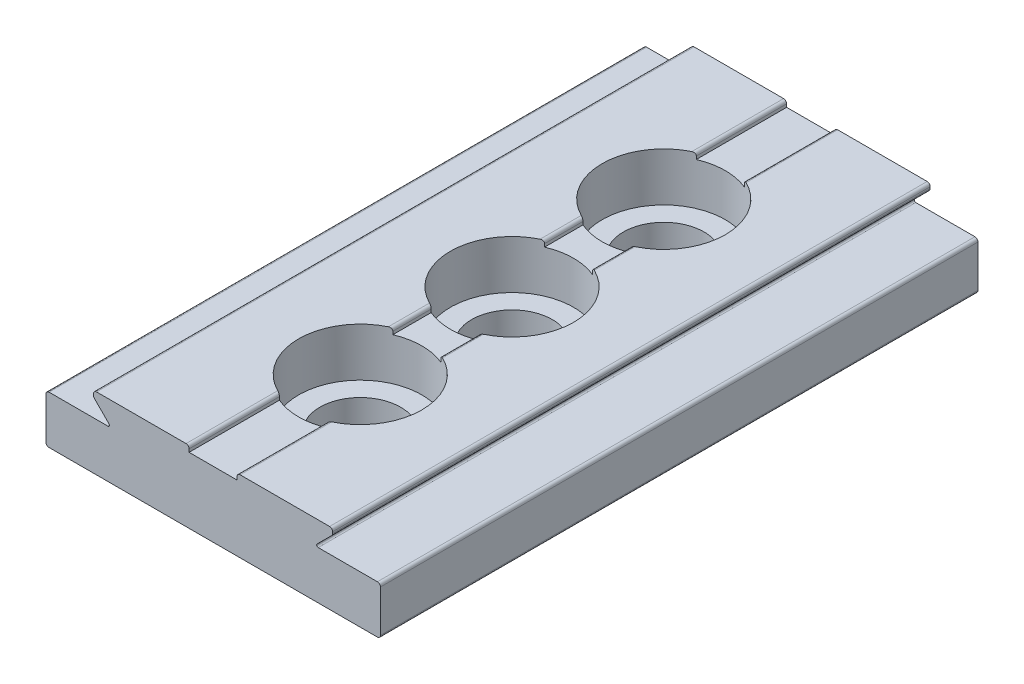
ISO-10303-21;
HEADER;
FILE_DESCRIPTION(('STEP AP214'),'2;1');
FILE_NAME('part.step','',(''),(''),'','','');
FILE_SCHEMA(('AUTOMOTIVE_DESIGN { 1 0 10303 214 1 1 1 1 }'));
ENDSEC;
DATA;
#1=APPLICATION_CONTEXT('core data for automotive mechanical design processes');
#2=APPLICATION_PROTOCOL_DEFINITION('international standard','automotive_design',2000,#1);
#3=PRODUCT_CONTEXT('',#1,'mechanical');
#4=PRODUCT('Part','Part','',(#3));
#5=PRODUCT_RELATED_PRODUCT_CATEGORY('part','',(#4));
#6=PRODUCT_DEFINITION_FORMATION('','',#4);
#7=PRODUCT_DEFINITION_CONTEXT('part definition',#1,'design');
#8=PRODUCT_DEFINITION('design','',#6,#7);
#9=PRODUCT_DEFINITION_SHAPE('','',#8);
#10=(LENGTH_UNIT() NAMED_UNIT(*) SI_UNIT(.MILLI.,.METRE.));
#11=(NAMED_UNIT(*) PLANE_ANGLE_UNIT() SI_UNIT($,.RADIAN.));
#12=(NAMED_UNIT(*) SI_UNIT($,.STERADIAN.) SOLID_ANGLE_UNIT());
#13=UNCERTAINTY_MEASURE_WITH_UNIT(LENGTH_MEASURE(1.E-05),#10,'distance_accuracy_value','');
#14=(GEOMETRIC_REPRESENTATION_CONTEXT(3) GLOBAL_UNCERTAINTY_ASSIGNED_CONTEXT((#13)) GLOBAL_UNIT_ASSIGNED_CONTEXT((#10,
#11,#12)) REPRESENTATION_CONTEXT('',''));
#15=CARTESIAN_POINT('',(0.,0.,0.));
#16=DIRECTION('',(0.,0.,1.));
#17=DIRECTION('',(1.,0.,0.));
#18=AXIS2_PLACEMENT_3D('',#15,#16,#17);
#19=CARTESIAN_POINT('',(-2.0193,2.5019,25.0063));
#20=DIRECTION('',(0.,-1.,0.));
#21=DIRECTION('',(0.,0.,-1.));
#22=AXIS2_PLACEMENT_3D('',#19,#20,#21);
#23=PLANE('',#22);
#24=DIRECTION('',(0.,0.,-1.));
#25=VECTOR('',#24,1.);
#26=CARTESIAN_POINT('',(1.9939,2.5019,25.0063));
#27=LINE('',#26,#25);
#28=CARTESIAN_POINT('',(1.9939,2.5019,-4.75507741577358));
#29=VERTEX_POINT('',#28);
#30=CARTESIAN_POINT('',(1.9939,2.5019,-7.94492258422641));
#31=VERTEX_POINT('',#30);
#32=EDGE_CURVE('E616',#29,#31,#27,.T.);
#33=ORIENTED_EDGE('',*,*,#32,.T.);
#34=CARTESIAN_POINT('',(0.,2.5019,-12.7));
#35=DIRECTION('',(0.,-1.,0.));
#36=DIRECTION('',(0.,0.,-1.));
#37=AXIS2_PLACEMENT_3D('',#34,#35,#36);
#38=CIRCLE('',#37,5.1562);
#39=CARTESIAN_POINT('',(-2.0193,2.5019,-7.9556532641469));
#40=VERTEX_POINT('',#39);
#41=EDGE_CURVE('E751',#31,#40,#38,.T.);
#42=ORIENTED_EDGE('',*,*,#41,.T.);
#43=DIRECTION('',(0.,0.,-1.));
#44=VECTOR('',#43,1.);
#45=CARTESIAN_POINT('',(-2.0193,2.5019,25.0063));
#46=LINE('',#45,#44);
#47=CARTESIAN_POINT('',(-2.0193,2.5019,-4.7443467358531));
#48=VERTEX_POINT('',#47);
#49=EDGE_CURVE('E750',#48,#40,#46,.T.);
#50=ORIENTED_EDGE('',*,*,#49,.F.);
#51=CARTESIAN_POINT('',(0.,2.5019,0.));
#52=DIRECTION('',(0.,-1.,0.));
#53=DIRECTION('',(0.,0.,-1.));
#54=AXIS2_PLACEMENT_3D('',#51,#52,#53);
#55=CIRCLE('',#54,5.1562);
#56=EDGE_CURVE('E540',#48,#29,#55,.T.);
#57=ORIENTED_EDGE('',*,*,#56,.T.);
#58=EDGE_LOOP('',(#33,#42,#50,#57));
#59=FACE_BOUND('',#58,.T.);
#60=ADVANCED_FACE('F16',(#59),#23,.F.);
#61=CARTESIAN_POINT('',(1.9939,2.5019,25.0063));
#62=DIRECTION('',(1.,0.,0.));
#63=DIRECTION('',(0.,1.,0.));
#64=AXIS2_PLACEMENT_3D('',#61,#62,#63);
#65=PLANE('',#64);
#66=CARTESIAN_POINT('',(1.9939,2.5019,-17.4550774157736));
#67=VERTEX_POINT('',#66);
#68=CARTESIAN_POINT('',(1.9939,2.5019,-25.0063));
#69=VERTEX_POINT('',#68);
#70=EDGE_CURVE('E614',#67,#69,#27,.T.);
#71=ORIENTED_EDGE('',*,*,#70,.F.);
#72=DIRECTION('',(0.,1.,0.));
#73=VECTOR('',#72,1.);
#74=CARTESIAN_POINT('',(1.9939,3.0099,-17.4550774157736));
#75=LINE('',#74,#73);
#76=CARTESIAN_POINT('',(1.9939,2.7559,-17.4550774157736));
#77=VERTEX_POINT('',#76);
#78=EDGE_CURVE('E903',#67,#77,#75,.T.);
#79=ORIENTED_EDGE('',*,*,#78,.T.);
#80=DIRECTION('',(0.,0.,-1.));
#81=VECTOR('',#80,1.);
#82=CARTESIAN_POINT('',(1.9939,2.7559,25.0063));
#83=LINE('',#82,#81);
#84=CARTESIAN_POINT('',(1.9939,2.7559,-25.0063));
#85=VERTEX_POINT('',#84);
#86=EDGE_CURVE('E612',#77,#85,#83,.T.);
#87=ORIENTED_EDGE('',*,*,#86,.T.);
#88=DIRECTION('',(0.,-1.,0.));
#89=VECTOR('',#88,1.);
#90=CARTESIAN_POINT('',(1.9939,2.5019,-25.0063));
#91=LINE('',#90,#89);
#92=EDGE_CURVE('E684',#85,#69,#91,.T.);
#93=ORIENTED_EDGE('',*,*,#92,.T.);
#94=EDGE_LOOP('',(#71,#79,#87,#93));
#95=FACE_BOUND('',#94,.T.);
#96=ADVANCED_FACE('F772',(#95),#65,.F.);
#97=CARTESIAN_POINT('',(-2.0193,2.7559,25.0063));
#98=DIRECTION('',(-1.,0.,0.));
#99=DIRECTION('',(0.,-1.,0.));
#100=AXIS2_PLACEMENT_3D('',#97,#98,#99);
#101=PLANE('',#100);
#102=ORIENTED_EDGE('',*,*,#49,.T.);
#103=DIRECTION('',(0.,1.,0.));
#104=VECTOR('',#103,1.);
#105=CARTESIAN_POINT('',(-2.0193,3.0099,-7.9556532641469));
#106=LINE('',#105,#104);
#107=CARTESIAN_POINT('',(-2.0193,2.7559,-7.9556532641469));
#108=VERTEX_POINT('',#107);
#109=EDGE_CURVE('E526',#40,#108,#106,.T.);
#110=ORIENTED_EDGE('',*,*,#109,.T.);
#111=DIRECTION('',(0.,0.,-1.));
#112=VECTOR('',#111,1.);
#113=CARTESIAN_POINT('',(-2.0193,2.7559,25.0063));
#114=LINE('',#113,#112);
#115=CARTESIAN_POINT('',(-2.0193,2.7559,-4.7443467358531));
#116=VERTEX_POINT('',#115);
#117=EDGE_CURVE('E898',#116,#108,#114,.T.);
#118=ORIENTED_EDGE('',*,*,#117,.F.);
#119=DIRECTION('',(0.,1.,0.));
#120=VECTOR('',#119,1.);
#121=CARTESIAN_POINT('',(-2.0193,3.0099,-4.7443467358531));
#122=LINE('',#121,#120);
#123=EDGE_CURVE('E542',#116,#48,#122,.F.);
#124=ORIENTED_EDGE('',*,*,#123,.T.);
#125=EDGE_LOOP('',(#102,#110,#118,#124));
#126=FACE_BOUND('',#125,.T.);
#127=ADVANCED_FACE('F767',(#126),#101,.F.);
#128=CARTESIAN_POINT('',(-2.2733,2.7559,25.0063));
#129=DIRECTION('',(0.,0.,-1.));
#130=DIRECTION('',(-1.,0.,0.));
#131=AXIS2_PLACEMENT_3D('',#128,#129,#130);
#132=CYLINDRICAL_SURFACE('',#131,0.254);
#133=ORIENTED_EDGE('',*,*,#117,.T.);
#134=CARTESIAN_POINT('',(-2.0193,2.7559,-7.9556532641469));
#135=CARTESIAN_POINT('',(-2.01928459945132,2.76933827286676,-7.95564834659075));
#136=CARTESIAN_POINT('',(-2.02036540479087,2.78276713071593,-7.956106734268));
#137=CARTESIAN_POINT('',(-2.02459932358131,2.80919562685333,-7.95791128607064));
#138=CARTESIAN_POINT('',(-2.0277466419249,2.82219635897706,-7.95925496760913));
#139=CARTESIAN_POINT('',(-2.03599380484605,2.8474347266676,-7.96279127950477));
#140=CARTESIAN_POINT('',(-2.0410932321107,2.85967252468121,-7.96498372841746));
#141=CARTESIAN_POINT('',(-2.05304264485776,2.88308248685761,-7.97015255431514));
#142=CARTESIAN_POINT('',(-2.05989330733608,2.89425423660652,-7.97312923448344));
#143=CARTESIAN_POINT('',(-2.07532895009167,2.91559358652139,-7.97988549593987));
#144=CARTESIAN_POINT('',(-2.08395947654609,2.92572140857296,-7.98368633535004));
#145=CARTESIAN_POINT('',(-2.10252837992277,2.9443846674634,-7.99193500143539));
#146=CARTESIAN_POINT('',(-2.11246698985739,2.9529198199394,-7.99638294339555));
#147=CARTESIAN_POINT('',(-2.13414957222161,2.9688495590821,-8.00617898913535));
#148=CARTESIAN_POINT('',(-2.14597320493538,2.9761093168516,-8.01156970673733));
#149=CARTESIAN_POINT('',(-2.17045285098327,2.98855264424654,-8.0228518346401));
#150=CARTESIAN_POINT('',(-2.18310952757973,2.99373453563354,-8.0287436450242));
#151=CARTESIAN_POINT('',(-2.20861548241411,3.00188138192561,-8.04075018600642));
#152=CARTESIAN_POINT('',(-2.22145311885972,3.00489588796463,-8.04685634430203));
#153=CARTESIAN_POINT('',(-2.24730534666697,3.00890480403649,-8.05928592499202));
#154=CARTESIAN_POINT('',(-2.260319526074,3.00990330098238,-8.06560888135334));
#155=CARTESIAN_POINT('',(-2.2733,3.0099,-8.07198686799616));
#156=B_SPLINE_CURVE_WITH_KNOTS('',3,(#134,#135,#136,#137,#138,#139,#140,#141,#142,#143,#144,
#145,#146,#147,#148,#149,#150,#151,#152,#153,#154,#155),.UNSPECIFIED.,.F.,.F.,(4,2,2,2,2,2,2,2,
2,2,4),(0.,0.040249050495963,0.0803857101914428,0.120513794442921,0.160657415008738,
0.201995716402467,0.243341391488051,0.287809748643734,0.332313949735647,0.375765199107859,
0.419128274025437),.UNSPECIFIED.);
#157=CARTESIAN_POINT('',(-2.2733,3.0099,-8.07198686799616));
#158=VERTEX_POINT('',#157);
#159=EDGE_CURVE('E518',#108,#158,#156,.T.);
#160=ORIENTED_EDGE('',*,*,#159,.T.);
#161=DIRECTION('',(0.,0.,-1.));
#162=VECTOR('',#161,1.);
#163=CARTESIAN_POINT('',(-2.2733,3.0099,25.0063));
#164=LINE('',#163,#162);
#165=CARTESIAN_POINT('',(-2.2733,3.0099,-4.62801313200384));
#166=VERTEX_POINT('',#165);
#167=EDGE_CURVE('E897',#166,#158,#164,.T.);
#168=ORIENTED_EDGE('',*,*,#167,.F.);
#169=CARTESIAN_POINT('',(-2.2733,3.0099,-4.62801313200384));
#170=CARTESIAN_POINT('',(-2.25801647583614,3.00990726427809,-4.63552420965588));
#171=CARTESIAN_POINT('',(-2.24268106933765,3.00852020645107,-4.64295938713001));
#172=CARTESIAN_POINT('',(-2.21230715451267,3.00295096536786,-4.65750692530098));
#173=CARTESIAN_POINT('',(-2.19726979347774,2.99875956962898,-4.66461813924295));
#174=CARTESIAN_POINT('',(-2.16796757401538,2.98756292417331,-4.67830947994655));
#175=CARTESIAN_POINT('',(-2.15370447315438,2.98055155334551,-4.68488841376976));
#176=CARTESIAN_POINT('',(-2.12652483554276,2.96381133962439,-4.69728781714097));
#177=CARTESIAN_POINT('',(-2.11360629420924,2.95408662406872,-4.7031094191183));
#178=CARTESIAN_POINT('',(-2.09047441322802,2.93287436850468,-4.71343452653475));
#179=CARTESIAN_POINT('',(-2.08013607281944,2.92155424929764,-4.71800117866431));
#180=CARTESIAN_POINT('',(-2.06153753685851,2.89700073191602,-4.72615751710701));
#181=CARTESIAN_POINT('',(-2.05327715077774,2.88376750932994,-4.72974729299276));
#182=CARTESIAN_POINT('',(-2.03990404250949,2.85711201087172,-4.73552935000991));
#183=CARTESIAN_POINT('',(-2.03457006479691,2.84382171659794,-4.73782053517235));
#184=CARTESIAN_POINT('',(-2.02620194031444,2.81642073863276,-4.74140540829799));
#185=CARTESIAN_POINT('',(-2.0231633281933,2.80231170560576,-4.74270103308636));
#186=CARTESIAN_POINT('',(-2.02066144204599,2.78271121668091,-4.74376707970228));
#187=CARTESIAN_POINT('',(-2.02015090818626,2.77735974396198,-4.74398449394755));
#188=CARTESIAN_POINT('',(-2.0194705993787,2.76663976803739,-4.74427413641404));
#189=CARTESIAN_POINT('',(-2.01930028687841,2.76127130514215,-4.74434659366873));
#190=CARTESIAN_POINT('',(-2.01929999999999,2.7559,-4.74434673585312));
#191=B_SPLINE_CURVE_WITH_KNOTS('',3,(#169,#170,#171,#172,#173,#174,#175,#176,#177,#178,#179,
#180,#181,#182,#183,#184,#185,#186,#187,#188,#189,#190),.UNSPECIFIED.,.F.,.F.,(4,2,2,2,2,2,2,2,
2,2,4),(0.,0.0510527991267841,0.102274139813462,0.15360726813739,0.204862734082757,
0.252590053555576,0.300312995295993,0.343598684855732,0.386799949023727,0.402930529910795,
0.419035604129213),.UNSPECIFIED.);
#192=EDGE_CURVE('E474',#166,#116,#191,.T.);
#193=ORIENTED_EDGE('',*,*,#192,.T.);
#194=EDGE_LOOP('',(#133,#160,#168,#193));
#195=FACE_BOUND('',#194,.T.);
#196=ADVANCED_FACE('F458',(#195),#132,.T.);
#197=CARTESIAN_POINT('',(2.2479,2.7559,25.0063));
#198=DIRECTION('',(0.,0.,-1.));
#199=DIRECTION('',(-1.,0.,0.));
#200=AXIS2_PLACEMENT_3D('',#197,#198,#199);
#201=CYLINDRICAL_SURFACE('',#200,0.254);
#202=DIRECTION('',(0.,0.,-1.));
#203=VECTOR('',#202,1.);
#204=CARTESIAN_POINT('',(2.2479,3.0099,25.0063));
#205=LINE('',#204,#203);
#206=CARTESIAN_POINT('',(2.2479,3.0099,-4.64040343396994));
#207=VERTEX_POINT('',#206);
#208=CARTESIAN_POINT('',(2.2479,3.0099,-8.05959656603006));
#209=VERTEX_POINT('',#208);
#210=EDGE_CURVE('E311',#207,#209,#205,.T.);
#211=ORIENTED_EDGE('',*,*,#210,.T.);
#212=CARTESIAN_POINT('',(2.2479,3.0099,-8.05959656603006));
#213=CARTESIAN_POINT('',(2.23264670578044,3.00990743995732,-8.05220388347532));
#214=CARTESIAN_POINT('',(2.21734273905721,3.00852569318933,-8.04488682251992));
#215=CARTESIAN_POINT('',(2.18703442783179,3.00298008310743,-8.03057268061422));
#216=CARTESIAN_POINT('',(2.17203119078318,2.9988073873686,-8.02357669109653));
#217=CARTESIAN_POINT('',(2.14279680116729,2.98766421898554,-8.01010849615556));
#218=CARTESIAN_POINT('',(2.12856736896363,2.98068778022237,-8.00363744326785));
#219=CARTESIAN_POINT('',(2.10144886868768,2.96403599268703,-7.99144063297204));
#220=CARTESIAN_POINT('',(2.08855785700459,2.95436463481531,-7.98571379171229));
#221=CARTESIAN_POINT('',(2.06544356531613,2.93325299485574,-7.97554335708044));
#222=CARTESIAN_POINT('',(2.05509952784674,2.92197427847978,-7.9710395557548));
#223=CARTESIAN_POINT('',(2.03648099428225,2.89751162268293,-7.96299178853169));
#224=CARTESIAN_POINT('',(2.02820633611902,2.8843278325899,-7.95944774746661));
#225=CARTESIAN_POINT('',(2.01477560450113,2.8577366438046,-7.95372500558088));
#226=CARTESIAN_POINT('',(2.00940507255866,2.84445745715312,-7.95145176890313));
#227=CARTESIAN_POINT('',(2.00096285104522,2.81707464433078,-7.94788810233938));
#228=CARTESIAN_POINT('',(1.99788679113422,2.80297264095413,-7.94659580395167));
#229=CARTESIAN_POINT('',(1.99531863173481,2.7832669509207,-7.9455176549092));
#230=CARTESIAN_POINT('',(1.99478666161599,2.77780513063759,-7.94529446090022));
#231=CARTESIAN_POINT('',(1.99407776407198,2.76686314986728,-7.94499711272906));
#232=CARTESIAN_POINT('',(1.99390027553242,2.76138303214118,-7.94492272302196));
#233=CARTESIAN_POINT('',(1.99389999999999,2.7559,-7.94492258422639));
#234=B_SPLINE_CURVE_WITH_KNOTS('',3,(#212,#213,#214,#215,#216,#217,#218,#219,#220,#221,#222,
#223,#224,#225,#226,#227,#228,#229,#230,#231,#232,#233),.UNSPECIFIED.,.F.,.F.,(4,2,2,2,2,2,2,2,
2,2,4),(0.,0.0508149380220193,0.101791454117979,0.152877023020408,0.203887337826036,
0.251486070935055,0.299081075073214,0.342368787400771,0.385573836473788,0.402039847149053,
0.4184797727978),.UNSPECIFIED.);
#235=CARTESIAN_POINT('',(1.9939,2.7559,-7.94492258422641));
#236=VERTEX_POINT('',#235);
#237=EDGE_CURVE('E11',#209,#236,#234,.T.);
#238=ORIENTED_EDGE('',*,*,#237,.T.);
#239=CARTESIAN_POINT('',(1.9939,2.7559,-4.75507741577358));
#240=VERTEX_POINT('',#239);
#241=EDGE_CURVE('E615',#240,#236,#83,.T.);
#242=ORIENTED_EDGE('',*,*,#241,.F.);
#243=CARTESIAN_POINT('',(1.9939,2.7559,-4.75507741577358));
#244=CARTESIAN_POINT('',(1.99388466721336,2.76935983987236,-4.75508220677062));
#245=CARTESIAN_POINT('',(1.9949688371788,2.78281042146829,-4.75462922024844));
#246=CARTESIAN_POINT('',(1.99921674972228,2.80928275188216,-4.75284548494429));
#247=CARTESIAN_POINT('',(2.00237478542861,2.82230557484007,-4.75151714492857));
#248=CARTESIAN_POINT('',(2.01065136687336,2.84758747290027,-4.74802046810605));
#249=CARTESIAN_POINT('',(2.01576953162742,2.85984669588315,-4.74585229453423));
#250=CARTESIAN_POINT('',(2.02776491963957,2.88329693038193,-4.7407394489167));
#251=CARTESIAN_POINT('',(2.03464279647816,2.89448754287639,-4.73779448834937));
#252=CARTESIAN_POINT('',(2.05013679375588,2.91585285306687,-4.73111091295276));
#253=CARTESIAN_POINT('',(2.05879756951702,2.92598863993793,-4.72735174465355));
#254=CARTESIAN_POINT('',(2.07743378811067,2.94466284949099,-4.71919174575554));
#255=CARTESIAN_POINT('',(2.0874094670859,2.95320098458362,-4.71479079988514));
#256=CARTESIAN_POINT('',(2.10915460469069,2.9691142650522,-4.70510539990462));
#257=CARTESIAN_POINT('',(2.12100204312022,2.97635759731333,-4.69977976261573));
#258=CARTESIAN_POINT('',(2.14553112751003,2.98876427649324,-4.68863269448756));
#259=CARTESIAN_POINT('',(2.15821341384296,2.99392600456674,-4.68281088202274));
#260=CARTESIAN_POINT('',(2.18366098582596,3.00199288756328,-4.67099693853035));
#261=CARTESIAN_POINT('',(2.19641052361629,3.00496519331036,-4.66501628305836));
#262=CARTESIAN_POINT('',(2.22208443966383,3.00891839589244,-4.65284269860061));
#263=CARTESIAN_POINT('',(2.23500841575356,3.00990327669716,-4.64665021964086));
#264=CARTESIAN_POINT('',(2.2479,3.0099,-4.64040343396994));
#265=B_SPLINE_CURVE_WITH_KNOTS('',3,(#243,#244,#245,#246,#247,#248,#249,#250,#251,#252,#253,
#254,#255,#256,#257,#258,#259,#260,#261,#262,#263,#264),.UNSPECIFIED.,.F.,.F.,(4,2,2,2,2,2,2,2,
2,2,4),(0.,0.0403139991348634,0.0805175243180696,0.120713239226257,0.160923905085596,
0.202301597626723,0.243686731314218,0.288117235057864,0.332582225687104,0.375619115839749,
0.418569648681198),.UNSPECIFIED.);
#266=EDGE_CURVE('E318',#240,#207,#265,.T.);
#267=ORIENTED_EDGE('',*,*,#266,.T.);
#268=EDGE_LOOP('',(#211,#238,#242,#267));
#269=FACE_BOUND('',#268,.T.);
#270=ADVANCED_FACE('F317',(#269),#201,.T.);
#271=CARTESIAN_POINT('',(1.9939,2.5019,7.94492258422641));
#272=VERTEX_POINT('',#271);
#273=CARTESIAN_POINT('',(1.9939,2.5019,4.75507741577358));
#274=VERTEX_POINT('',#273);
#275=EDGE_CURVE('E613',#272,#274,#27,.T.);
#276=ORIENTED_EDGE('',*,*,#275,.T.);
#277=CARTESIAN_POINT('',(-2.0193,2.5019,4.7443467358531));
#278=VERTEX_POINT('',#277);
#279=EDGE_CURVE('E543',#274,#278,#55,.T.);
#280=ORIENTED_EDGE('',*,*,#279,.T.);
#281=CARTESIAN_POINT('',(-2.0193,2.5019,7.9556532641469));
#282=VERTEX_POINT('',#281);
#283=EDGE_CURVE('E403',#282,#278,#46,.T.);
#284=ORIENTED_EDGE('',*,*,#283,.F.);
#285=CARTESIAN_POINT('',(0.,2.5019,12.7));
#286=DIRECTION('',(0.,-1.,0.));
#287=DIRECTION('',(0.,0.,-1.));
#288=AXIS2_PLACEMENT_3D('',#285,#286,#287);
#289=CIRCLE('',#288,5.1562);
#290=EDGE_CURVE('E587',#282,#272,#289,.T.);
#291=ORIENTED_EDGE('',*,*,#290,.T.);
#292=EDGE_LOOP('',(#276,#280,#284,#291));
#293=FACE_BOUND('',#292,.T.);
#294=ADVANCED_FACE('F773',(#293),#23,.F.);
#295=ORIENTED_EDGE('',*,*,#241,.T.);
#296=DIRECTION('',(0.,1.,0.));
#297=VECTOR('',#296,1.);
#298=CARTESIAN_POINT('',(1.9939,3.0099,-7.94492258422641));
#299=LINE('',#298,#297);
#300=EDGE_CURVE('E302',#236,#31,#299,.F.);
#301=ORIENTED_EDGE('',*,*,#300,.T.);
#302=ORIENTED_EDGE('',*,*,#32,.F.);
#303=DIRECTION('',(0.,1.,0.));
#304=VECTOR('',#303,1.);
#305=CARTESIAN_POINT('',(1.9939,3.0099,-4.75507741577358));
#306=LINE('',#305,#304);
#307=EDGE_CURVE('E537',#29,#240,#306,.T.);
#308=ORIENTED_EDGE('',*,*,#307,.T.);
#309=EDGE_LOOP('',(#295,#301,#302,#308));
#310=FACE_BOUND('',#309,.T.);
#311=ADVANCED_FACE('F745',(#310),#65,.F.);
#312=ORIENTED_EDGE('',*,*,#283,.T.);
#313=DIRECTION('',(0.,1.,0.));
#314=VECTOR('',#313,1.);
#315=CARTESIAN_POINT('',(-2.0193,3.0099,4.7443467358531));
#316=LINE('',#315,#314);
#317=CARTESIAN_POINT('',(-2.0193,2.7559,4.7443467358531));
#318=VERTEX_POINT('',#317);
#319=EDGE_CURVE('E560',#278,#318,#316,.T.);
#320=ORIENTED_EDGE('',*,*,#319,.T.);
#321=CARTESIAN_POINT('',(-2.0193,2.7559,7.9556532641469));
#322=VERTEX_POINT('',#321);
#323=EDGE_CURVE('E398',#322,#318,#114,.T.);
#324=ORIENTED_EDGE('',*,*,#323,.F.);
#325=DIRECTION('',(0.,1.,0.));
#326=VECTOR('',#325,1.);
#327=CARTESIAN_POINT('',(-2.0193,3.0099,7.9556532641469));
#328=LINE('',#327,#326);
#329=EDGE_CURVE('E448',#322,#282,#328,.F.);
#330=ORIENTED_EDGE('',*,*,#329,.T.);
#331=EDGE_LOOP('',(#312,#320,#324,#330));
#332=FACE_BOUND('',#331,.T.);
#333=ADVANCED_FACE('F780',(#332),#101,.F.);
#334=ORIENTED_EDGE('',*,*,#323,.T.);
#335=CARTESIAN_POINT('',(-2.0193,2.7559,4.7443467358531));
#336=CARTESIAN_POINT('',(-2.01928459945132,2.76933827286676,4.74435165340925));
#337=CARTESIAN_POINT('',(-2.02036540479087,2.78276713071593,4.743893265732));
#338=CARTESIAN_POINT('',(-2.02459932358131,2.80919562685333,4.74208871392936));
#339=CARTESIAN_POINT('',(-2.0277466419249,2.82219635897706,4.74074503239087));
#340=CARTESIAN_POINT('',(-2.03599380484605,2.8474347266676,4.73720872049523));
#341=CARTESIAN_POINT('',(-2.0410932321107,2.85967252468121,4.73501627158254));
#342=CARTESIAN_POINT('',(-2.05304264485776,2.88308248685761,4.72984744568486));
#343=CARTESIAN_POINT('',(-2.05989330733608,2.89425423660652,4.72687076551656));
#344=CARTESIAN_POINT('',(-2.07532895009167,2.91559358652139,4.72011450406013));
#345=CARTESIAN_POINT('',(-2.08395947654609,2.92572140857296,4.71631366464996));
#346=CARTESIAN_POINT('',(-2.10252837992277,2.9443846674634,4.70806499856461));
#347=CARTESIAN_POINT('',(-2.11246698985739,2.9529198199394,4.70361705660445));
#348=CARTESIAN_POINT('',(-2.13414957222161,2.9688495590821,4.69382101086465));
#349=CARTESIAN_POINT('',(-2.14597320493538,2.9761093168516,4.68843029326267));
#350=CARTESIAN_POINT('',(-2.17045285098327,2.98855264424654,4.6771481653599));
#351=CARTESIAN_POINT('',(-2.18310952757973,2.99373453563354,4.6712563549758));
#352=CARTESIAN_POINT('',(-2.20861548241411,3.00188138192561,4.65924981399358));
#353=CARTESIAN_POINT('',(-2.22145311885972,3.00489588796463,4.65314365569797));
#354=CARTESIAN_POINT('',(-2.24730534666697,3.00890480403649,4.64071407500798));
#355=CARTESIAN_POINT('',(-2.260319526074,3.00990330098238,4.63439111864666));
#356=CARTESIAN_POINT('',(-2.2733,3.0099,4.62801313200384));
#357=B_SPLINE_CURVE_WITH_KNOTS('',3,(#335,#336,#337,#338,#339,#340,#341,#342,#343,#344,#345,
#346,#347,#348,#349,#350,#351,#352,#353,#354,#355,#356),.UNSPECIFIED.,.F.,.F.,(4,2,2,2,2,2,2,2,
2,2,4),(0.,0.040249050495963,0.0803857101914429,0.120513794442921,0.160657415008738,
0.201995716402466,0.243341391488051,0.287809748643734,0.332313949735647,0.375765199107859,
0.419128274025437),.UNSPECIFIED.);
#358=CARTESIAN_POINT('',(-2.2733,3.0099,4.62801313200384));
#359=VERTEX_POINT('',#358);
#360=EDGE_CURVE('E483',#318,#359,#357,.T.);
#361=ORIENTED_EDGE('',*,*,#360,.T.);
#362=CARTESIAN_POINT('',(-2.2733,3.0099,8.07198686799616));
#363=VERTEX_POINT('',#362);
#364=EDGE_CURVE('E393',#363,#359,#164,.T.);
#365=ORIENTED_EDGE('',*,*,#364,.F.);
#366=CARTESIAN_POINT('',(-2.2733,3.0099,8.07198686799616));
#367=CARTESIAN_POINT('',(-2.25801647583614,3.00990726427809,8.06447579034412));
#368=CARTESIAN_POINT('',(-2.24268106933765,3.00852020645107,8.05704061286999));
#369=CARTESIAN_POINT('',(-2.21230715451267,3.00295096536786,8.04249307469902));
#370=CARTESIAN_POINT('',(-2.19726979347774,2.99875956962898,8.03538186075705));
#371=CARTESIAN_POINT('',(-2.16796757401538,2.98756292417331,8.02169052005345));
#372=CARTESIAN_POINT('',(-2.15370447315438,2.98055155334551,8.01511158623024));
#373=CARTESIAN_POINT('',(-2.12652483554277,2.96381133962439,8.00271218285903));
#374=CARTESIAN_POINT('',(-2.11360629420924,2.95408662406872,7.9968905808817));
#375=CARTESIAN_POINT('',(-2.09047441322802,2.93287436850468,7.98656547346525));
#376=CARTESIAN_POINT('',(-2.08013607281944,2.92155424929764,7.98199882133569));
#377=CARTESIAN_POINT('',(-2.06153753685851,2.89700073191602,7.97384248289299));
#378=CARTESIAN_POINT('',(-2.05327715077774,2.88376750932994,7.97025270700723));
#379=CARTESIAN_POINT('',(-2.03990404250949,2.85711201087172,7.96447064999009));
#380=CARTESIAN_POINT('',(-2.03457006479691,2.84382171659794,7.96217946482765));
#381=CARTESIAN_POINT('',(-2.02620194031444,2.81642073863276,7.95859459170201));
#382=CARTESIAN_POINT('',(-2.0231633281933,2.80231170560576,7.95729896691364));
#383=CARTESIAN_POINT('',(-2.02066144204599,2.78271121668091,7.95623292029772));
#384=CARTESIAN_POINT('',(-2.02015090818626,2.77735974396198,7.95601550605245));
#385=CARTESIAN_POINT('',(-2.0194705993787,2.76663976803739,7.95572586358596));
#386=CARTESIAN_POINT('',(-2.01930028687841,2.76127130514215,7.95565340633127));
#387=CARTESIAN_POINT('',(-2.01929999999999,2.7559,7.95565326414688));
#388=B_SPLINE_CURVE_WITH_KNOTS('',3,(#366,#367,#368,#369,#370,#371,#372,#373,#374,#375,#376,
#377,#378,#379,#380,#381,#382,#383,#384,#385,#386,#387),.UNSPECIFIED.,.F.,.F.,(4,2,2,2,2,2,2,2,
2,2,4),(0.,0.0510527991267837,0.102274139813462,0.15360726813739,0.204862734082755,
0.252590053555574,0.300312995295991,0.343598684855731,0.386799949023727,0.402930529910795,
0.419035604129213),.UNSPECIFIED.);
#389=EDGE_CURVE('E438',#363,#322,#388,.T.);
#390=ORIENTED_EDGE('',*,*,#389,.T.);
#391=EDGE_LOOP('',(#334,#361,#365,#390));
#392=FACE_BOUND('',#391,.T.);
#393=ADVANCED_FACE('F781',(#392),#132,.T.);
#394=CARTESIAN_POINT('',(2.2479,3.0099,8.05959656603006));
#395=VERTEX_POINT('',#394);
#396=CARTESIAN_POINT('',(2.2479,3.0099,4.64040343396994));
#397=VERTEX_POINT('',#396);
#398=EDGE_CURVE('E319',#395,#397,#205,.T.);
#399=ORIENTED_EDGE('',*,*,#398,.T.);
#400=CARTESIAN_POINT('',(2.2479,3.0099,4.64040343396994));
#401=CARTESIAN_POINT('',(2.23264670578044,3.00990743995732,4.64779611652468));
#402=CARTESIAN_POINT('',(2.21734273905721,3.00852569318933,4.65511317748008));
#403=CARTESIAN_POINT('',(2.18703442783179,3.00298008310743,4.66942731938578));
#404=CARTESIAN_POINT('',(2.17203119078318,2.9988073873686,4.67642330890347));
#405=CARTESIAN_POINT('',(2.14279680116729,2.98766421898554,4.68989150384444));
#406=CARTESIAN_POINT('',(2.12856736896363,2.98068778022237,4.69636255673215));
#407=CARTESIAN_POINT('',(2.10144886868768,2.96403599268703,4.70855936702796));
#408=CARTESIAN_POINT('',(2.08855785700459,2.95436463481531,4.71428620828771));
#409=CARTESIAN_POINT('',(2.06544356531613,2.93325299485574,4.72445664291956));
#410=CARTESIAN_POINT('',(2.05509952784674,2.92197427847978,4.7289604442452));
#411=CARTESIAN_POINT('',(2.03648099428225,2.89751162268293,4.73700821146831));
#412=CARTESIAN_POINT('',(2.02820633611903,2.8843278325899,4.74055225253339));
#413=CARTESIAN_POINT('',(2.01477560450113,2.8577366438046,4.74627499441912));
#414=CARTESIAN_POINT('',(2.00940507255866,2.84445745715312,4.74854823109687));
#415=CARTESIAN_POINT('',(2.00096285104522,2.81707464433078,4.75211189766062));
#416=CARTESIAN_POINT('',(1.99788679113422,2.80297264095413,4.75340419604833));
#417=CARTESIAN_POINT('',(1.99531863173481,2.7832669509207,4.7544823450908));
#418=CARTESIAN_POINT('',(1.99478666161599,2.77780513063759,4.75470553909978));
#419=CARTESIAN_POINT('',(1.99407776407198,2.76686314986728,4.75500288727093));
#420=CARTESIAN_POINT('',(1.99390027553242,2.76138303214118,4.75507727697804));
#421=CARTESIAN_POINT('',(1.99389999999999,2.7559,4.75507741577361));
#422=B_SPLINE_CURVE_WITH_KNOTS('',3,(#400,#401,#402,#403,#404,#405,#406,#407,#408,#409,#410,
#411,#412,#413,#414,#415,#416,#417,#418,#419,#420,#421),.UNSPECIFIED.,.F.,.F.,(4,2,2,2,2,2,2,2,
2,2,4),(0.,0.0508149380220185,0.101791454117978,0.152877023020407,0.203887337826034,
0.251486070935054,0.299081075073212,0.34236878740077,0.385573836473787,0.402039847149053,
0.4184797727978),.UNSPECIFIED.);
#423=CARTESIAN_POINT('',(1.9939,2.7559,4.75507741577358));
#424=VERTEX_POINT('',#423);
#425=EDGE_CURVE('E789',#397,#424,#422,.T.);
#426=ORIENTED_EDGE('',*,*,#425,.T.);
#427=CARTESIAN_POINT('',(1.9939,2.7559,7.94492258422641));
#428=VERTEX_POINT('',#427);
#429=EDGE_CURVE('E742',#428,#424,#83,.T.);
#430=ORIENTED_EDGE('',*,*,#429,.F.);
#431=CARTESIAN_POINT('',(1.9939,2.7559,7.94492258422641));
#432=CARTESIAN_POINT('',(1.99388466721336,2.76935983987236,7.94491779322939));
#433=CARTESIAN_POINT('',(1.9949688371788,2.78281042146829,7.94537077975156));
#434=CARTESIAN_POINT('',(1.99921674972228,2.80928275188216,7.94715451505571));
#435=CARTESIAN_POINT('',(2.00237478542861,2.82230557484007,7.94848285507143));
#436=CARTESIAN_POINT('',(2.01065136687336,2.84758747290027,7.95197953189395));
#437=CARTESIAN_POINT('',(2.01576953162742,2.85984669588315,7.95414770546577));
#438=CARTESIAN_POINT('',(2.02776491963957,2.88329693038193,7.9592605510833));
#439=CARTESIAN_POINT('',(2.03464279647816,2.89448754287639,7.96220551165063));
#440=CARTESIAN_POINT('',(2.05013679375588,2.91585285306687,7.96888908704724));
#441=CARTESIAN_POINT('',(2.05879756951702,2.92598863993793,7.97264825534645));
#442=CARTESIAN_POINT('',(2.07743378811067,2.94466284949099,7.98080825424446));
#443=CARTESIAN_POINT('',(2.0874094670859,2.95320098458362,7.98520920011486));
#444=CARTESIAN_POINT('',(2.10915460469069,2.9691142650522,7.99489460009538));
#445=CARTESIAN_POINT('',(2.12100204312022,2.97635759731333,8.00022023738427));
#446=CARTESIAN_POINT('',(2.14553112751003,2.98876427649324,8.01136730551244));
#447=CARTESIAN_POINT('',(2.15821341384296,2.99392600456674,8.01718911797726));
#448=CARTESIAN_POINT('',(2.18366098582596,3.00199288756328,8.02900306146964));
#449=CARTESIAN_POINT('',(2.19641052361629,3.00496519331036,8.03498371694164));
#450=CARTESIAN_POINT('',(2.22208443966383,3.00891839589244,8.04715730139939));
#451=CARTESIAN_POINT('',(2.23500841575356,3.00990327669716,8.05334978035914));
#452=CARTESIAN_POINT('',(2.2479,3.0099,8.05959656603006));
#453=B_SPLINE_CURVE_WITH_KNOTS('',3,(#431,#432,#433,#434,#435,#436,#437,#438,#439,#440,#441,
#442,#443,#444,#445,#446,#447,#448,#449,#450,#451,#452),.UNSPECIFIED.,.F.,.F.,(4,2,2,2,2,2,2,2,
2,2,4),(0.,0.0403139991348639,0.0805175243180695,0.120713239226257,0.160923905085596,
0.202301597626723,0.243686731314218,0.288117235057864,0.332582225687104,0.375619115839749,
0.418569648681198),.UNSPECIFIED.);
#454=EDGE_CURVE('E402',#428,#395,#453,.T.);
#455=ORIENTED_EDGE('',*,*,#454,.T.);
#456=EDGE_LOOP('',(#399,#426,#430,#455));
#457=FACE_BOUND('',#456,.T.);
#458=ADVANCED_FACE('F770',(#457),#201,.T.);
#459=CARTESIAN_POINT('',(1.9939,2.5019,25.0063));
#460=VERTEX_POINT('',#459);
#461=CARTESIAN_POINT('',(1.9939,2.5019,17.4550774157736));
#462=VERTEX_POINT('',#461);
#463=EDGE_CURVE('E605',#460,#462,#27,.T.);
#464=ORIENTED_EDGE('',*,*,#463,.T.);
#465=CARTESIAN_POINT('',(-2.0193,2.5019,17.4443467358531));
#466=VERTEX_POINT('',#465);
#467=EDGE_CURVE('E589',#462,#466,#289,.T.);
#468=ORIENTED_EDGE('',*,*,#467,.T.);
#469=CARTESIAN_POINT('',(-2.0193,2.5019,25.0063));
#470=VERTEX_POINT('',#469);
#471=EDGE_CURVE('E399',#470,#466,#46,.T.);
#472=ORIENTED_EDGE('',*,*,#471,.F.);
#473=DIRECTION('',(-1.,0.,0.));
#474=VECTOR('',#473,1.);
#475=CARTESIAN_POINT('',(-2.0193,2.5019,25.0063));
#476=LINE('',#475,#474);
#477=EDGE_CURVE('E611',#460,#470,#476,.T.);
#478=ORIENTED_EDGE('',*,*,#477,.F.);
#479=EDGE_LOOP('',(#464,#468,#472,#478));
#480=FACE_BOUND('',#479,.T.);
#481=ADVANCED_FACE('F609',(#480),#23,.F.);
#482=ORIENTED_EDGE('',*,*,#471,.T.);
#483=DIRECTION('',(0.,1.,0.));
#484=VECTOR('',#483,1.);
#485=CARTESIAN_POINT('',(-2.0193,3.0099,17.4443467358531));
#486=LINE('',#485,#484);
#487=CARTESIAN_POINT('',(-2.0193,2.7559,17.4443467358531));
#488=VERTEX_POINT('',#487);
#489=EDGE_CURVE('E594',#466,#488,#486,.T.);
#490=ORIENTED_EDGE('',*,*,#489,.T.);
#491=CARTESIAN_POINT('',(-2.0193,2.7559,25.0063));
#492=VERTEX_POINT('',#491);
#493=EDGE_CURVE('E394',#492,#488,#114,.T.);
#494=ORIENTED_EDGE('',*,*,#493,.F.);
#495=DIRECTION('',(0.,1.,0.));
#496=VECTOR('',#495,1.);
#497=CARTESIAN_POINT('',(-2.0193,2.7559,25.0063));
#498=LINE('',#497,#496);
#499=EDGE_CURVE('E688',#470,#492,#498,.T.);
#500=ORIENTED_EDGE('',*,*,#499,.F.);
#501=EDGE_LOOP('',(#482,#490,#494,#500));
#502=FACE_BOUND('',#501,.T.);
#503=ADVANCED_FACE('F768',(#502),#101,.F.);
#504=ORIENTED_EDGE('',*,*,#493,.T.);
#505=CARTESIAN_POINT('',(-2.0193,2.7559,17.4443467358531));
#506=CARTESIAN_POINT('',(-2.01928459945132,2.76933827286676,17.4443516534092));
#507=CARTESIAN_POINT('',(-2.02036540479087,2.78276713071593,17.443893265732));
#508=CARTESIAN_POINT('',(-2.02459932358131,2.80919562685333,17.4420887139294));
#509=CARTESIAN_POINT('',(-2.0277466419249,2.82219635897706,17.4407450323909));
#510=CARTESIAN_POINT('',(-2.03599380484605,2.8474347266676,17.4372087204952));
#511=CARTESIAN_POINT('',(-2.0410932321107,2.85967252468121,17.4350162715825));
#512=CARTESIAN_POINT('',(-2.05304264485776,2.88308248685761,17.4298474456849));
#513=CARTESIAN_POINT('',(-2.05989330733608,2.89425423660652,17.4268707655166));
#514=CARTESIAN_POINT('',(-2.07532895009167,2.91559358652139,17.4201145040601));
#515=CARTESIAN_POINT('',(-2.08395947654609,2.92572140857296,17.41631366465));
#516=CARTESIAN_POINT('',(-2.10252837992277,2.9443846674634,17.4080649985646));
#517=CARTESIAN_POINT('',(-2.11246698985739,2.9529198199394,17.4036170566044));
#518=CARTESIAN_POINT('',(-2.13414957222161,2.9688495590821,17.3938210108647));
#519=CARTESIAN_POINT('',(-2.14597320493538,2.9761093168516,17.3884302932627));
#520=CARTESIAN_POINT('',(-2.17045285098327,2.98855264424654,17.3771481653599));
#521=CARTESIAN_POINT('',(-2.18310952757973,2.99373453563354,17.3712563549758));
#522=CARTESIAN_POINT('',(-2.20861548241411,3.00188138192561,17.3592498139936));
#523=CARTESIAN_POINT('',(-2.22145311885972,3.00489588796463,17.353143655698));
#524=CARTESIAN_POINT('',(-2.24730534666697,3.00890480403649,17.340714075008));
#525=CARTESIAN_POINT('',(-2.260319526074,3.00990330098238,17.3343911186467));
#526=CARTESIAN_POINT('',(-2.2733,3.0099,17.3280131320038));
#527=B_SPLINE_CURVE_WITH_KNOTS('',3,(#505,#506,#507,#508,#509,#510,#511,#512,#513,#514,#515,
#516,#517,#518,#519,#520,#521,#522,#523,#524,#525,#526),.UNSPECIFIED.,.F.,.F.,(4,2,2,2,2,2,2,2,
2,2,4),(0.,0.040249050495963,0.080385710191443,0.120513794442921,0.160657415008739,
0.201995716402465,0.243341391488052,0.287809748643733,0.332313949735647,0.375765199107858,
0.419128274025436),.UNSPECIFIED.);
#528=CARTESIAN_POINT('',(-2.2733,3.0099,17.3280131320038));
#529=VERTEX_POINT('',#528);
#530=EDGE_CURVE('E466',#488,#529,#527,.T.);
#531=ORIENTED_EDGE('',*,*,#530,.T.);
#532=CARTESIAN_POINT('',(-2.2733,3.0099,25.0063));
#533=VERTEX_POINT('',#532);
#534=EDGE_CURVE('E389',#533,#529,#164,.T.);
#535=ORIENTED_EDGE('',*,*,#534,.F.);
#536=CARTESIAN_POINT('',(-2.2733,2.7559,25.0063));
#537=DIRECTION('',(0.,0.,1.));
#538=DIRECTION('',(-1.,0.,0.));
#539=AXIS2_PLACEMENT_3D('',#536,#537,#538);
#540=CIRCLE('',#539,0.254);
#541=EDGE_CURVE('E689',#492,#533,#540,.T.);
#542=ORIENTED_EDGE('',*,*,#541,.F.);
#543=EDGE_LOOP('',(#504,#531,#535,#542));
#544=FACE_BOUND('',#543,.T.);
#545=ADVANCED_FACE('F459',(#544),#132,.T.);
#546=ORIENTED_EDGE('',*,*,#429,.T.);
#547=DIRECTION('',(0.,1.,0.));
#548=VECTOR('',#547,1.);
#549=CARTESIAN_POINT('',(1.9939,3.0099,4.75507741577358));
#550=LINE('',#549,#548);
#551=EDGE_CURVE('E550',#424,#274,#550,.F.);
#552=ORIENTED_EDGE('',*,*,#551,.T.);
#553=ORIENTED_EDGE('',*,*,#275,.F.);
#554=DIRECTION('',(0.,1.,0.));
#555=VECTOR('',#554,1.);
#556=CARTESIAN_POINT('',(1.9939,3.0099,7.94492258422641));
#557=LINE('',#556,#555);
#558=EDGE_CURVE('E585',#272,#428,#557,.T.);
#559=ORIENTED_EDGE('',*,*,#558,.T.);
#560=EDGE_LOOP('',(#546,#552,#553,#559));
#561=FACE_BOUND('',#560,.T.);
#562=ADVANCED_FACE('F769',(#561),#65,.F.);
#563=CARTESIAN_POINT('',(2.2479,3.0099,25.0063));
#564=VERTEX_POINT('',#563);
#565=CARTESIAN_POINT('',(2.2479,3.0099,17.3404034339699));
#566=VERTEX_POINT('',#565);
#567=EDGE_CURVE('E322',#564,#566,#205,.T.);
#568=ORIENTED_EDGE('',*,*,#567,.T.);
#569=CARTESIAN_POINT('',(2.2479,3.0099,17.3404034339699));
#570=CARTESIAN_POINT('',(2.23264670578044,3.00990743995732,17.3477961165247));
#571=CARTESIAN_POINT('',(2.21734273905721,3.00852569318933,17.3551131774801));
#572=CARTESIAN_POINT('',(2.18703442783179,3.00298008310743,17.3694273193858));
#573=CARTESIAN_POINT('',(2.17203119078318,2.9988073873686,17.3764233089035));
#574=CARTESIAN_POINT('',(2.14279680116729,2.98766421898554,17.3898915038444));
#575=CARTESIAN_POINT('',(2.12856736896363,2.98068778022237,17.3963625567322));
#576=CARTESIAN_POINT('',(2.10144886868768,2.96403599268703,17.408559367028));
#577=CARTESIAN_POINT('',(2.08855785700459,2.95436463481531,17.4142862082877));
#578=CARTESIAN_POINT('',(2.06544356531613,2.93325299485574,17.4244566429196));
#579=CARTESIAN_POINT('',(2.05509952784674,2.92197427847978,17.4289604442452));
#580=CARTESIAN_POINT('',(2.03648099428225,2.89751162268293,17.4370082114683));
#581=CARTESIAN_POINT('',(2.02820633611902,2.8843278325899,17.4405522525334));
#582=CARTESIAN_POINT('',(2.01477560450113,2.8577366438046,17.4462749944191));
#583=CARTESIAN_POINT('',(2.00940507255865,2.84445745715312,17.4485482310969));
#584=CARTESIAN_POINT('',(2.00096285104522,2.81707464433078,17.4521118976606));
#585=CARTESIAN_POINT('',(1.99788679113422,2.80297264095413,17.4534041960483));
#586=CARTESIAN_POINT('',(1.99531863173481,2.78326695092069,17.4544823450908));
#587=CARTESIAN_POINT('',(1.99478666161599,2.77780513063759,17.4547055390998));
#588=CARTESIAN_POINT('',(1.99407776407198,2.76686314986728,17.4550028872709));
#589=CARTESIAN_POINT('',(1.99390027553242,2.76138303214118,17.455077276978));
#590=CARTESIAN_POINT('',(1.99389999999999,2.7559,17.4550774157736));
#591=B_SPLINE_CURVE_WITH_KNOTS('',3,(#569,#570,#571,#572,#573,#574,#575,#576,#577,#578,#579,
#580,#581,#582,#583,#584,#585,#586,#587,#588,#589,#590),.UNSPECIFIED.,.F.,.F.,(4,2,2,2,2,2,2,2,
2,2,4),(0.,0.0508149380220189,0.101791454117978,0.152877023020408,0.203887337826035,
0.251486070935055,0.299081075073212,0.342368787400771,0.385573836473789,0.402039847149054,
0.418479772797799),.UNSPECIFIED.);
#592=CARTESIAN_POINT('',(1.9939,2.7559,17.4550774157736));
#593=VERTEX_POINT('',#592);
#594=EDGE_CURVE('E411',#566,#593,#591,.T.);
#595=ORIENTED_EDGE('',*,*,#594,.T.);
#596=CARTESIAN_POINT('',(1.9939,2.7559,25.0063));
#597=VERTEX_POINT('',#596);
#598=EDGE_CURVE('E323',#597,#593,#83,.T.);
#599=ORIENTED_EDGE('',*,*,#598,.F.);
#600=CARTESIAN_POINT('',(2.2479,2.7559,25.0063));
#601=DIRECTION('',(0.,0.,1.));
#602=DIRECTION('',(1.,0.,0.));
#603=AXIS2_PLACEMENT_3D('',#600,#601,#602);
#604=CIRCLE('',#603,0.254);
#605=EDGE_CURVE('E625',#564,#597,#604,.T.);
#606=ORIENTED_EDGE('',*,*,#605,.F.);
#607=EDGE_LOOP('',(#568,#595,#599,#606));
#608=FACE_BOUND('',#607,.T.);
#609=ADVANCED_FACE('F741',(#608),#201,.T.);
#610=CARTESIAN_POINT('',(-2.0193,2.5019,-17.4443467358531));
#611=VERTEX_POINT('',#610);
#612=CARTESIAN_POINT('',(-2.0193,2.5019,-25.0063));
#613=VERTEX_POINT('',#612);
#614=EDGE_CURVE('E397',#611,#613,#46,.T.);
#615=ORIENTED_EDGE('',*,*,#614,.F.);
#616=EDGE_CURVE('E901',#611,#67,#38,.T.);
#617=ORIENTED_EDGE('',*,*,#616,.T.);
#618=ORIENTED_EDGE('',*,*,#70,.T.);
#619=DIRECTION('',(-1.,0.,0.));
#620=VECTOR('',#619,1.);
#621=CARTESIAN_POINT('',(-2.0193,2.5019,-25.0063));
#622=LINE('',#621,#620);
#623=EDGE_CURVE('E632',#69,#613,#622,.T.);
#624=ORIENTED_EDGE('',*,*,#623,.T.);
#625=EDGE_LOOP('',(#615,#617,#618,#624));
#626=FACE_BOUND('',#625,.T.);
#627=ADVANCED_FACE('F18',(#626),#23,.F.);
#628=CARTESIAN_POINT('',(-2.0193,2.7559,-17.4443467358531));
#629=VERTEX_POINT('',#628);
#630=CARTESIAN_POINT('',(-2.0193,2.7559,-25.0063));
#631=VERTEX_POINT('',#630);
#632=EDGE_CURVE('E392',#629,#631,#114,.T.);
#633=ORIENTED_EDGE('',*,*,#632,.F.);
#634=DIRECTION('',(0.,1.,0.));
#635=VECTOR('',#634,1.);
#636=CARTESIAN_POINT('',(-2.0193,3.0099,-17.4443467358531));
#637=LINE('',#636,#635);
#638=EDGE_CURVE('E499',#629,#611,#637,.F.);
#639=ORIENTED_EDGE('',*,*,#638,.T.);
#640=ORIENTED_EDGE('',*,*,#614,.T.);
#641=DIRECTION('',(0.,1.,0.));
#642=VECTOR('',#641,1.);
#643=CARTESIAN_POINT('',(-2.0193,2.7559,-25.0063));
#644=LINE('',#643,#642);
#645=EDGE_CURVE('E634',#613,#631,#644,.T.);
#646=ORIENTED_EDGE('',*,*,#645,.T.);
#647=EDGE_LOOP('',(#633,#639,#640,#646));
#648=FACE_BOUND('',#647,.T.);
#649=ADVANCED_FACE('F456',(#648),#101,.F.);
#650=CARTESIAN_POINT('',(-2.2733,3.0099,-17.3280131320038));
#651=VERTEX_POINT('',#650);
#652=CARTESIAN_POINT('',(-2.2733,3.0099,-25.0063));
#653=VERTEX_POINT('',#652);
#654=EDGE_CURVE('E388',#651,#653,#164,.T.);
#655=ORIENTED_EDGE('',*,*,#654,.F.);
#656=CARTESIAN_POINT('',(-2.2733,3.0099,-17.3280131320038));
#657=CARTESIAN_POINT('',(-2.25801647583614,3.00990726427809,-17.3355242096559));
#658=CARTESIAN_POINT('',(-2.24268106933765,3.00852020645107,-17.34295938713));
#659=CARTESIAN_POINT('',(-2.21230715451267,3.00295096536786,-17.357506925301));
#660=CARTESIAN_POINT('',(-2.19726979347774,2.99875956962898,-17.364618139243));
#661=CARTESIAN_POINT('',(-2.16796757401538,2.98756292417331,-17.3783094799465));
#662=CARTESIAN_POINT('',(-2.15370447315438,2.98055155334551,-17.3848884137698));
#663=CARTESIAN_POINT('',(-2.12652483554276,2.96381133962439,-17.397287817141));
#664=CARTESIAN_POINT('',(-2.11360629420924,2.95408662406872,-17.4031094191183));
#665=CARTESIAN_POINT('',(-2.09047441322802,2.93287436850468,-17.4134345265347));
#666=CARTESIAN_POINT('',(-2.08013607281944,2.92155424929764,-17.4180011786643));
#667=CARTESIAN_POINT('',(-2.06153753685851,2.89700073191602,-17.426157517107));
#668=CARTESIAN_POINT('',(-2.05327715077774,2.88376750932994,-17.4297472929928));
#669=CARTESIAN_POINT('',(-2.03990404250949,2.85711201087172,-17.4355293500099));
#670=CARTESIAN_POINT('',(-2.03457006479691,2.84382171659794,-17.4378205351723));
#671=CARTESIAN_POINT('',(-2.02620194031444,2.81642073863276,-17.441405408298));
#672=CARTESIAN_POINT('',(-2.0231633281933,2.80231170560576,-17.4427010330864));
#673=CARTESIAN_POINT('',(-2.02066144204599,2.78271121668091,-17.4437670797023));
#674=CARTESIAN_POINT('',(-2.02015090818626,2.77735974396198,-17.4439844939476));
#675=CARTESIAN_POINT('',(-2.0194705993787,2.76663976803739,-17.444274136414));
#676=CARTESIAN_POINT('',(-2.01930028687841,2.76127130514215,-17.4443465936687));
#677=CARTESIAN_POINT('',(-2.01929999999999,2.7559,-17.4443467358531));
#678=B_SPLINE_CURVE_WITH_KNOTS('',3,(#656,#657,#658,#659,#660,#661,#662,#663,#664,#665,#666,
#667,#668,#669,#670,#671,#672,#673,#674,#675,#676,#677),.UNSPECIFIED.,.F.,.F.,(4,2,2,2,2,2,2,2,
2,2,4),(0.,0.0510527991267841,0.102274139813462,0.153607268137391,0.204862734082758,
0.252590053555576,0.300312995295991,0.343598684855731,0.386799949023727,0.402930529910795,
0.419035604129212),.UNSPECIFIED.);
#679=EDGE_CURVE('E491',#651,#629,#678,.T.);
#680=ORIENTED_EDGE('',*,*,#679,.T.);
#681=ORIENTED_EDGE('',*,*,#632,.T.);
#682=CARTESIAN_POINT('',(-2.2733,2.7559,-25.0063));
#683=DIRECTION('',(0.,0.,1.));
#684=DIRECTION('',(-1.,0.,0.));
#685=AXIS2_PLACEMENT_3D('',#682,#683,#684);
#686=CIRCLE('',#685,0.254);
#687=EDGE_CURVE('E637',#631,#653,#686,.T.);
#688=ORIENTED_EDGE('',*,*,#687,.T.);
#689=EDGE_LOOP('',(#655,#680,#681,#688));
#690=FACE_BOUND('',#689,.T.);
#691=ADVANCED_FACE('F451',(#690),#132,.T.);
#692=CARTESIAN_POINT('',(-9.7663,3.0099,25.0063));
#693=DIRECTION('',(0.,-1.,0.));
#694=DIRECTION('',(0.,0.,-1.));
#695=AXIS2_PLACEMENT_3D('',#692,#693,#694);
#696=PLANE('',#695);
#697=ORIENTED_EDGE('',*,*,#167,.T.);
#698=CARTESIAN_POINT('',(0.,3.0099,-12.7));
#699=DIRECTION('',(0.,1.,0.));
#700=DIRECTION('',(0.,0.,1.));
#701=AXIS2_PLACEMENT_3D('',#698,#699,#700);
#702=CIRCLE('',#701,5.1562);
#703=EDGE_CURVE('E315',#651,#158,#702,.T.);
#704=ORIENTED_EDGE('',*,*,#703,.F.);
#705=ORIENTED_EDGE('',*,*,#654,.T.);
#706=DIRECTION('',(-1.,0.,0.));
#707=VECTOR('',#706,1.);
#708=CARTESIAN_POINT('',(-9.7663,3.0099,-25.0063));
#709=LINE('',#708,#707);
#710=CARTESIAN_POINT('',(-9.7663,3.0099,-25.0063));
#711=VERTEX_POINT('',#710);
#712=EDGE_CURVE('E640',#653,#711,#709,.T.);
#713=ORIENTED_EDGE('',*,*,#712,.T.);
#714=DIRECTION('',(0.,0.,-1.));
#715=VECTOR('',#714,1.);
#716=CARTESIAN_POINT('',(-9.7663,3.0099,25.0063));
#717=LINE('',#716,#715);
#718=CARTESIAN_POINT('',(-9.7663,3.0099,25.0063));
#719=VERTEX_POINT('',#718);
#720=EDGE_CURVE('E385',#719,#711,#717,.T.);
#721=ORIENTED_EDGE('',*,*,#720,.F.);
#722=DIRECTION('',(-1.,0.,0.));
#723=VECTOR('',#722,1.);
#724=CARTESIAN_POINT('',(-9.7663,3.0099,25.0063));
#725=LINE('',#724,#723);
#726=EDGE_CURVE('E693',#533,#719,#725,.T.);
#727=ORIENTED_EDGE('',*,*,#726,.F.);
#728=ORIENTED_EDGE('',*,*,#534,.T.);
#729=CARTESIAN_POINT('',(0.,3.0099,12.7));
#730=DIRECTION('',(0.,1.,0.));
#731=DIRECTION('',(0.,0.,1.));
#732=AXIS2_PLACEMENT_3D('',#729,#730,#731);
#733=CIRCLE('',#732,5.1562);
#734=EDGE_CURVE('E567',#363,#529,#733,.T.);
#735=ORIENTED_EDGE('',*,*,#734,.F.);
#736=ORIENTED_EDGE('',*,*,#364,.T.);
#737=CARTESIAN_POINT('',(0.,3.0099,0.));
#738=DIRECTION('',(0.,1.,0.));
#739=DIRECTION('',(0.,0.,1.));
#740=AXIS2_PLACEMENT_3D('',#737,#738,#739);
#741=CIRCLE('',#740,5.1562);
#742=EDGE_CURVE('E525',#166,#359,#741,.T.);
#743=ORIENTED_EDGE('',*,*,#742,.F.);
#744=EDGE_LOOP('',(#697,#704,#705,#713,#721,#727,#728,#735,#736,#743));
#745=FACE_BOUND('',#744,.T.);
#746=ADVANCED_FACE('F455',(#745),#696,.F.);
#747=CARTESIAN_POINT('',(-9.7663,2.7559,25.0063));
#748=DIRECTION('',(0.,0.,-1.));
#749=DIRECTION('',(-1.,0.,0.));
#750=AXIS2_PLACEMENT_3D('',#747,#748,#749);
#751=CYLINDRICAL_SURFACE('',#750,0.254);
#752=CARTESIAN_POINT('',(-9.7663,2.7559,-25.0063));
#753=DIRECTION('',(0.,0.,1.));
#754=DIRECTION('',(1.,0.,0.));
#755=AXIS2_PLACEMENT_3D('',#752,#753,#754);
#756=CIRCLE('',#755,0.254);
#757=CARTESIAN_POINT('',(-10.0203,2.7559,-25.0063));
#758=VERTEX_POINT('',#757);
#759=EDGE_CURVE('E642',#711,#758,#756,.T.);
#760=ORIENTED_EDGE('',*,*,#759,.T.);
#761=DIRECTION('',(0.,0.,-1.));
#762=VECTOR('',#761,1.);
#763=CARTESIAN_POINT('',(-10.0203,2.7559,25.0063));
#764=LINE('',#763,#762);
#765=CARTESIAN_POINT('',(-10.0203,2.7559,25.0063));
#766=VERTEX_POINT('',#765);
#767=EDGE_CURVE('E382',#766,#758,#764,.T.);
#768=ORIENTED_EDGE('',*,*,#767,.F.);
#769=CARTESIAN_POINT('',(-9.7663,2.7559,25.0063));
#770=DIRECTION('',(0.,0.,1.));
#771=DIRECTION('',(1.,0.,0.));
#772=AXIS2_PLACEMENT_3D('',#769,#770,#771);
#773=CIRCLE('',#772,0.254);
#774=EDGE_CURVE('E695',#719,#766,#773,.T.);
#775=ORIENTED_EDGE('',*,*,#774,.F.);
#776=ORIENTED_EDGE('',*,*,#720,.T.);
#777=EDGE_LOOP('',(#760,#768,#775,#776));
#778=FACE_BOUND('',#777,.T.);
#779=ADVANCED_FACE('F890',(#778),#751,.T.);
#780=CARTESIAN_POINT('',(-10.0203,2.62198911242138,25.0063));
#781=DIRECTION('',(1.,0.,0.));
#782=DIRECTION('',(0.,0.,-1.));
#783=AXIS2_PLACEMENT_3D('',#780,#781,#782);
#784=PLANE('',#783);
#785=DIRECTION('',(0.,-1.,0.));
#786=VECTOR('',#785,1.);
#787=CARTESIAN_POINT('',(-10.0203,2.62198911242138,-25.0063));
#788=LINE('',#787,#786);
#789=CARTESIAN_POINT('',(-10.0203,2.62198911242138,-25.0063));
#790=VERTEX_POINT('',#789);
#791=EDGE_CURVE('E644',#758,#790,#788,.T.);
#792=ORIENTED_EDGE('',*,*,#791,.T.);
#793=DIRECTION('',(0.,0.,-1.));
#794=VECTOR('',#793,1.);
#795=CARTESIAN_POINT('',(-10.0203,2.62198911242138,25.0063));
#796=LINE('',#795,#794);
#797=CARTESIAN_POINT('',(-10.0203,2.62198911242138,25.0063));
#798=VERTEX_POINT('',#797);
#799=EDGE_CURVE('E379',#798,#790,#796,.T.);
#800=ORIENTED_EDGE('',*,*,#799,.F.);
#801=DIRECTION('',(0.,-1.,0.));
#802=VECTOR('',#801,1.);
#803=CARTESIAN_POINT('',(-10.0203,2.62198911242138,25.0063));
#804=LINE('',#803,#802);
#805=EDGE_CURVE('E697',#766,#798,#804,.T.);
#806=ORIENTED_EDGE('',*,*,#805,.F.);
#807=ORIENTED_EDGE('',*,*,#767,.T.);
#808=EDGE_LOOP('',(#792,#800,#806,#807));
#809=FACE_BOUND('',#808,.T.);
#810=ADVANCED_FACE('F885',(#809),#784,.F.);
#811=CARTESIAN_POINT('',(-9.7663,2.62198911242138,25.0063));
#812=DIRECTION('',(0.,0.,-1.));
#813=DIRECTION('',(-1.,0.,0.));
#814=AXIS2_PLACEMENT_3D('',#811,#812,#813);
#815=CYLINDRICAL_SURFACE('',#814,0.254000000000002);
#816=CARTESIAN_POINT('',(-9.7663,2.62198911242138,-25.0063));
#817=DIRECTION('',(0.,0.,1.));
#818=DIRECTION('',(-1.,0.,0.));
#819=AXIS2_PLACEMENT_3D('',#816,#817,#818);
#820=CIRCLE('',#819,0.254000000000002);
#821=CARTESIAN_POINT('',(-9.94590512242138,2.44238399,-25.0063));
#822=VERTEX_POINT('',#821);
#823=EDGE_CURVE('E646',#790,#822,#820,.T.);
#824=ORIENTED_EDGE('',*,*,#823,.T.);
#825=DIRECTION('',(0.,0.,-1.));
#826=VECTOR('',#825,1.);
#827=CARTESIAN_POINT('',(-9.94590512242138,2.44238399,25.0063));
#828=LINE('',#827,#826);
#829=CARTESIAN_POINT('',(-9.94590512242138,2.44238399,25.0063));
#830=VERTEX_POINT('',#829);
#831=EDGE_CURVE('E376',#830,#822,#828,.T.);
#832=ORIENTED_EDGE('',*,*,#831,.F.);
#833=CARTESIAN_POINT('',(-9.7663,2.62198911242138,25.0063));
#834=DIRECTION('',(0.,0.,1.));
#835=DIRECTION('',(-1.,0.,0.));
#836=AXIS2_PLACEMENT_3D('',#833,#834,#835);
#837=CIRCLE('',#836,0.254000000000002);
#838=EDGE_CURVE('E699',#798,#830,#837,.T.);
#839=ORIENTED_EDGE('',*,*,#838,.F.);
#840=ORIENTED_EDGE('',*,*,#799,.T.);
#841=EDGE_LOOP('',(#824,#832,#839,#840));
#842=FACE_BOUND('',#841,.T.);
#843=ADVANCED_FACE('F880',(#842),#815,.T.);
#844=CARTESIAN_POINT('',(-8.72362369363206,1.22010256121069,25.0063));
#845=DIRECTION('',(0.707106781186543,0.707106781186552,0.));
#846=DIRECTION('',(-0.707106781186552,0.707106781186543,0.));
#847=AXIS2_PLACEMENT_3D('',#844,#845,#846);
#848=PLANE('',#847);
#849=DIRECTION('',(0.707106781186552,-0.707106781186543,0.));
#850=VECTOR('',#849,1.);
#851=CARTESIAN_POINT('',(-8.72362369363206,1.22010256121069,-25.0063));
#852=LINE('',#851,#850);
#853=CARTESIAN_POINT('',(-8.72362369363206,1.22010256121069,-25.0063));
#854=VERTEX_POINT('',#853);
#855=EDGE_CURVE('E648',#822,#854,#852,.T.);
#856=ORIENTED_EDGE('',*,*,#855,.T.);
#857=DIRECTION('',(0.,0.,-1.));
#858=VECTOR('',#857,1.);
#859=CARTESIAN_POINT('',(-8.72362369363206,1.22010256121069,25.0063));
#860=LINE('',#859,#858);
#861=CARTESIAN_POINT('',(-8.72362369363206,1.22010256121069,25.0063));
#862=VERTEX_POINT('',#861);
#863=EDGE_CURVE('E373',#862,#854,#860,.T.);
#864=ORIENTED_EDGE('',*,*,#863,.F.);
#865=DIRECTION('',(0.707106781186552,-0.707106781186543,0.));
#866=VECTOR('',#865,1.);
#867=CARTESIAN_POINT('',(-8.72362369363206,1.22010256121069,25.0063));
#868=LINE('',#867,#866);
#869=EDGE_CURVE('E701',#830,#862,#868,.T.);
#870=ORIENTED_EDGE('',*,*,#869,.F.);
#871=ORIENTED_EDGE('',*,*,#831,.T.);
#872=EDGE_LOOP('',(#856,#864,#870,#871));
#873=FACE_BOUND('',#872,.T.);
#874=ADVANCED_FACE('F876',(#873),#848,.F.);
#875=CARTESIAN_POINT('',(-8.81342625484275,1.1303,25.0063));
#876=DIRECTION('',(0.,0.,-1.));
#877=DIRECTION('',(-1.,0.,0.));
#878=AXIS2_PLACEMENT_3D('',#875,#876,#877);
#879=CYLINDRICAL_SURFACE('',#878,0.126999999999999);
#880=CARTESIAN_POINT('',(-8.81342625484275,1.1303,-25.0063));
#881=DIRECTION('',(0.,0.,-1.));
#882=DIRECTION('',(1.,0.,0.));
#883=AXIS2_PLACEMENT_3D('',#880,#881,#882);
#884=CIRCLE('',#883,0.126999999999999);
#885=CARTESIAN_POINT('',(-8.81342625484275,1.0033,-25.0063));
#886=VERTEX_POINT('',#885);
#887=EDGE_CURVE('E650',#854,#886,#884,.T.);
#888=ORIENTED_EDGE('',*,*,#887,.T.);
#889=DIRECTION('',(0.,0.,-1.));
#890=VECTOR('',#889,1.);
#891=CARTESIAN_POINT('',(-8.81342625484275,1.0033,25.0063));
#892=LINE('',#891,#890);
#893=CARTESIAN_POINT('',(-8.81342625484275,1.0033,25.0063));
#894=VERTEX_POINT('',#893);
#895=EDGE_CURVE('E370',#894,#886,#892,.T.);
#896=ORIENTED_EDGE('',*,*,#895,.F.);
#897=CARTESIAN_POINT('',(-8.81342625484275,1.1303,25.0063));
#898=DIRECTION('',(0.,0.,-1.));
#899=DIRECTION('',(1.,0.,0.));
#900=AXIS2_PLACEMENT_3D('',#897,#898,#899);
#901=CIRCLE('',#900,0.126999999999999);
#902=EDGE_CURVE('E703',#862,#894,#901,.T.);
#903=ORIENTED_EDGE('',*,*,#902,.F.);
#904=ORIENTED_EDGE('',*,*,#863,.T.);
#905=EDGE_LOOP('',(#888,#896,#903,#904));
#906=FACE_BOUND('',#905,.T.);
#907=ADVANCED_FACE('F871',(#906),#879,.F.);
#908=CARTESIAN_POINT('',(-13.7414,1.0033,25.0063));
#909=DIRECTION('',(0.,-1.,0.));
#910=DIRECTION('',(0.,0.,-1.));
#911=AXIS2_PLACEMENT_3D('',#908,#909,#910);
#912=PLANE('',#911);
#913=DIRECTION('',(-1.,0.,0.));
#914=VECTOR('',#913,1.);
#915=CARTESIAN_POINT('',(-13.7414,1.0033,-25.0063));
#916=LINE('',#915,#914);
#917=CARTESIAN_POINT('',(-13.7414,1.0033,-25.0063));
#918=VERTEX_POINT('',#917);
#919=EDGE_CURVE('E652',#886,#918,#916,.T.);
#920=ORIENTED_EDGE('',*,*,#919,.T.);
#921=DIRECTION('',(0.,0.,-1.));
#922=VECTOR('',#921,1.);
#923=CARTESIAN_POINT('',(-13.7414,1.0033,25.0063));
#924=LINE('',#923,#922);
#925=CARTESIAN_POINT('',(-13.7414,1.0033,25.0063));
#926=VERTEX_POINT('',#925);
#927=EDGE_CURVE('E367',#926,#918,#924,.T.);
#928=ORIENTED_EDGE('',*,*,#927,.F.);
#929=DIRECTION('',(-1.,0.,0.));
#930=VECTOR('',#929,1.);
#931=CARTESIAN_POINT('',(-13.7414,1.0033,25.0063));
#932=LINE('',#931,#930);
#933=EDGE_CURVE('E705',#894,#926,#932,.T.);
#934=ORIENTED_EDGE('',*,*,#933,.F.);
#935=ORIENTED_EDGE('',*,*,#895,.T.);
#936=EDGE_LOOP('',(#920,#928,#934,#935));
#937=FACE_BOUND('',#936,.T.);
#938=ADVANCED_FACE('F865',(#937),#912,.F.);
#939=CARTESIAN_POINT('',(-13.7414,0.7493,25.0063));
#940=DIRECTION('',(0.,0.,-1.));
#941=DIRECTION('',(-1.,0.,0.));
#942=AXIS2_PLACEMENT_3D('',#939,#940,#941);
#943=CYLINDRICAL_SURFACE('',#942,0.254);
#944=CARTESIAN_POINT('',(-13.7414,0.7493,-25.0063));
#945=DIRECTION('',(0.,0.,1.));
#946=DIRECTION('',(-1.,0.,0.));
#947=AXIS2_PLACEMENT_3D('',#944,#945,#946);
#948=CIRCLE('',#947,0.254);
#949=CARTESIAN_POINT('',(-13.9954,0.7493,-25.0063));
#950=VERTEX_POINT('',#949);
#951=EDGE_CURVE('E654',#918,#950,#948,.T.);
#952=ORIENTED_EDGE('',*,*,#951,.T.);
#953=DIRECTION('',(0.,0.,-1.));
#954=VECTOR('',#953,1.);
#955=CARTESIAN_POINT('',(-13.9954,0.7493,25.0063));
#956=LINE('',#955,#954);
#957=CARTESIAN_POINT('',(-13.9954,0.7493,25.0063));
#958=VERTEX_POINT('',#957);
#959=EDGE_CURVE('E364',#958,#950,#956,.T.);
#960=ORIENTED_EDGE('',*,*,#959,.F.);
#961=CARTESIAN_POINT('',(-13.7414,0.7493,25.0063));
#962=DIRECTION('',(0.,0.,1.));
#963=DIRECTION('',(-1.,0.,0.));
#964=AXIS2_PLACEMENT_3D('',#961,#962,#963);
#965=CIRCLE('',#964,0.254);
#966=EDGE_CURVE('E707',#926,#958,#965,.T.);
#967=ORIENTED_EDGE('',*,*,#966,.F.);
#968=ORIENTED_EDGE('',*,*,#927,.T.);
#969=EDGE_LOOP('',(#952,#960,#967,#968));
#970=FACE_BOUND('',#969,.T.);
#971=ADVANCED_FACE('F861',(#970),#943,.T.);
#972=CARTESIAN_POINT('',(-13.9954,-2.7559,25.0063));
#973=DIRECTION('',(1.,0.,0.));
#974=DIRECTION('',(0.,0.,-1.));
#975=AXIS2_PLACEMENT_3D('',#972,#973,#974);
#976=PLANE('',#975);
#977=DIRECTION('',(0.,-1.,0.));
#978=VECTOR('',#977,1.);
#979=CARTESIAN_POINT('',(-13.9954,-2.7559,-25.0063));
#980=LINE('',#979,#978);
#981=CARTESIAN_POINT('',(-13.9954,-2.7559,-25.0063));
#982=VERTEX_POINT('',#981);
#983=EDGE_CURVE('E656',#950,#982,#980,.T.);
#984=ORIENTED_EDGE('',*,*,#983,.T.);
#985=DIRECTION('',(0.,0.,-1.));
#986=VECTOR('',#985,1.);
#987=CARTESIAN_POINT('',(-13.9954,-2.7559,25.0063));
#988=LINE('',#987,#986);
#989=CARTESIAN_POINT('',(-13.9954,-2.7559,25.0063));
#990=VERTEX_POINT('',#989);
#991=EDGE_CURVE('E361',#990,#982,#988,.T.);
#992=ORIENTED_EDGE('',*,*,#991,.F.);
#993=DIRECTION('',(0.,-1.,0.));
#994=VECTOR('',#993,1.);
#995=CARTESIAN_POINT('',(-13.9954,-2.7559,25.0063));
#996=LINE('',#995,#994);
#997=EDGE_CURVE('E709',#958,#990,#996,.T.);
#998=ORIENTED_EDGE('',*,*,#997,.F.);
#999=ORIENTED_EDGE('',*,*,#959,.T.);
#1000=EDGE_LOOP('',(#984,#992,#998,#999));
#1001=FACE_BOUND('',#1000,.T.);
#1002=ADVANCED_FACE('F857',(#1001),#976,.F.);
#1003=CARTESIAN_POINT('',(-13.7414,-2.7559,25.0063));
#1004=DIRECTION('',(0.,0.,-1.));
#1005=DIRECTION('',(-1.,0.,0.));
#1006=AXIS2_PLACEMENT_3D('',#1003,#1004,#1005);
#1007=CYLINDRICAL_SURFACE('',#1006,0.254);
#1008=CARTESIAN_POINT('',(-13.7414,-2.7559,-25.0063));
#1009=DIRECTION('',(0.,0.,1.));
#1010=DIRECTION('',(-1.,0.,0.));
#1011=AXIS2_PLACEMENT_3D('',#1008,#1009,#1010);
#1012=CIRCLE('',#1011,0.254);
#1013=CARTESIAN_POINT('',(-13.7414,-3.0099,-25.0063));
#1014=VERTEX_POINT('',#1013);
#1015=EDGE_CURVE('E658',#982,#1014,#1012,.T.);
#1016=ORIENTED_EDGE('',*,*,#1015,.T.);
#1017=DIRECTION('',(0.,0.,-1.));
#1018=VECTOR('',#1017,1.);
#1019=CARTESIAN_POINT('',(-13.7414,-3.0099,25.0063));
#1020=LINE('',#1019,#1018);
#1021=CARTESIAN_POINT('',(-13.7414,-3.0099,25.0063));
#1022=VERTEX_POINT('',#1021);
#1023=EDGE_CURVE('E358',#1022,#1014,#1020,.T.);
#1024=ORIENTED_EDGE('',*,*,#1023,.F.);
#1025=CARTESIAN_POINT('',(-13.7414,-2.7559,25.0063));
#1026=DIRECTION('',(0.,0.,1.));
#1027=DIRECTION('',(-1.,0.,0.));
#1028=AXIS2_PLACEMENT_3D('',#1025,#1026,#1027);
#1029=CIRCLE('',#1028,0.254);
#1030=EDGE_CURVE('E711',#990,#1022,#1029,.T.);
#1031=ORIENTED_EDGE('',*,*,#1030,.F.);
#1032=ORIENTED_EDGE('',*,*,#991,.T.);
#1033=EDGE_LOOP('',(#1016,#1024,#1031,#1032));
#1034=FACE_BOUND('',#1033,.T.);
#1035=ADVANCED_FACE('F822',(#1034),#1007,.T.);
#1036=CARTESIAN_POINT('',(-13.7414,-3.0099,25.0063));
#1037=DIRECTION('',(0.,1.,0.));
#1038=DIRECTION('',(-1.,0.,0.));
#1039=AXIS2_PLACEMENT_3D('',#1036,#1037,#1038);
#1040=PLANE('',#1039);
#1041=CARTESIAN_POINT('',(0.,-3.0099,-12.7));
#1042=DIRECTION('',(0.,1.,0.));
#1043=DIRECTION('',(0.,0.,1.));
#1044=AXIS2_PLACEMENT_3D('',#1041,#1042,#1043);
#1045=CIRCLE('',#1044,3.3782);
#1046=CARTESIAN_POINT('',(0.,-3.0099,-9.3218));
#1047=VERTEX_POINT('',#1046);
#1048=EDGE_CURVE('E905',#1047,#1047,#1045,.T.);
#1049=ORIENTED_EDGE('',*,*,#1048,.T.);
#1050=EDGE_LOOP('',(#1049));
#1051=FACE_BOUND('',#1050,.T.);
#1052=CARTESIAN_POINT('',(0.,-3.0099,0.));
#1053=DIRECTION('',(0.,1.,0.));
#1054=DIRECTION('',(0.,0.,1.));
#1055=AXIS2_PLACEMENT_3D('',#1052,#1053,#1054);
#1056=CIRCLE('',#1055,3.3782);
#1057=CARTESIAN_POINT('',(0.,-3.0099,3.3782));
#1058=VERTEX_POINT('',#1057);
#1059=EDGE_CURVE('E534',#1058,#1058,#1056,.T.);
#1060=ORIENTED_EDGE('',*,*,#1059,.T.);
#1061=EDGE_LOOP('',(#1060));
#1062=FACE_BOUND('',#1061,.T.);
#1063=CARTESIAN_POINT('',(0.,-3.0099,12.7));
#1064=DIRECTION('',(0.,1.,0.));
#1065=DIRECTION('',(0.,0.,1.));
#1066=AXIS2_PLACEMENT_3D('',#1063,#1064,#1065);
#1067=CIRCLE('',#1066,3.3782);
#1068=CARTESIAN_POINT('',(0.,-3.0099,16.0782));
#1069=VERTEX_POINT('',#1068);
#1070=EDGE_CURVE('E582',#1069,#1069,#1067,.T.);
#1071=ORIENTED_EDGE('',*,*,#1070,.T.);
#1072=EDGE_LOOP('',(#1071));
#1073=FACE_BOUND('',#1072,.T.);
#1074=DIRECTION('',(1.,0.,0.));
#1075=VECTOR('',#1074,1.);
#1076=CARTESIAN_POINT('',(-13.7414,-3.0099,-25.0063));
#1077=LINE('',#1076,#1075);
#1078=CARTESIAN_POINT('',(13.7414,-3.0099,-25.0063));
#1079=VERTEX_POINT('',#1078);
#1080=EDGE_CURVE('E660',#1014,#1079,#1077,.T.);
#1081=ORIENTED_EDGE('',*,*,#1080,.T.);
#1082=DIRECTION('',(0.,0.,-1.));
#1083=VECTOR('',#1082,1.);
#1084=CARTESIAN_POINT('',(13.7414,-3.0099,25.0063));
#1085=LINE('',#1084,#1083);
#1086=CARTESIAN_POINT('',(13.7414,-3.0099,25.0063));
#1087=VERTEX_POINT('',#1086);
#1088=EDGE_CURVE('E355',#1087,#1079,#1085,.T.);
#1089=ORIENTED_EDGE('',*,*,#1088,.F.);
#1090=DIRECTION('',(1.,0.,0.));
#1091=VECTOR('',#1090,1.);
#1092=CARTESIAN_POINT('',(-13.7414,-3.0099,25.0063));
#1093=LINE('',#1092,#1091);
#1094=EDGE_CURVE('E713',#1022,#1087,#1093,.T.);
#1095=ORIENTED_EDGE('',*,*,#1094,.F.);
#1096=ORIENTED_EDGE('',*,*,#1023,.T.);
#1097=EDGE_LOOP('',(#1081,#1089,#1095,#1096));
#1098=FACE_BOUND('',#1097,.T.);
#1099=ADVANCED_FACE('F818',(#1051,#1062,#1073,#1098),#1040,.F.);
#1100=CARTESIAN_POINT('',(13.7414,-2.7559,25.0063));
#1101=DIRECTION('',(0.,0.,-1.));
#1102=DIRECTION('',(-1.,0.,0.));
#1103=AXIS2_PLACEMENT_3D('',#1100,#1101,#1102);
#1104=CYLINDRICAL_SURFACE('',#1103,0.254);
#1105=CARTESIAN_POINT('',(13.7414,-2.7559,-25.0063));
#1106=DIRECTION('',(0.,0.,1.));
#1107=DIRECTION('',(-1.,0.,0.));
#1108=AXIS2_PLACEMENT_3D('',#1105,#1106,#1107);
#1109=CIRCLE('',#1108,0.254);
#1110=CARTESIAN_POINT('',(13.9954,-2.7559,-25.0063));
#1111=VERTEX_POINT('',#1110);
#1112=EDGE_CURVE('E662',#1079,#1111,#1109,.T.);
#1113=ORIENTED_EDGE('',*,*,#1112,.T.);
#1114=DIRECTION('',(0.,0.,-1.));
#1115=VECTOR('',#1114,1.);
#1116=CARTESIAN_POINT('',(13.9954,-2.7559,25.0063));
#1117=LINE('',#1116,#1115);
#1118=CARTESIAN_POINT('',(13.9954,-2.7559,25.0063));
#1119=VERTEX_POINT('',#1118);
#1120=EDGE_CURVE('E352',#1119,#1111,#1117,.T.);
#1121=ORIENTED_EDGE('',*,*,#1120,.F.);
#1122=CARTESIAN_POINT('',(13.7414,-2.7559,25.0063));
#1123=DIRECTION('',(0.,0.,1.));
#1124=DIRECTION('',(-1.,0.,0.));
#1125=AXIS2_PLACEMENT_3D('',#1122,#1123,#1124);
#1126=CIRCLE('',#1125,0.254);
#1127=EDGE_CURVE('E715',#1087,#1119,#1126,.T.);
#1128=ORIENTED_EDGE('',*,*,#1127,.F.);
#1129=ORIENTED_EDGE('',*,*,#1088,.T.);
#1130=EDGE_LOOP('',(#1113,#1121,#1128,#1129));
#1131=FACE_BOUND('',#1130,.T.);
#1132=ADVANCED_FACE('F821',(#1131),#1104,.T.);
#1133=CARTESIAN_POINT('',(13.9954,0.7493,25.0063));
#1134=DIRECTION('',(-1.,0.,0.));
#1135=DIRECTION('',(0.,0.,1.));
#1136=AXIS2_PLACEMENT_3D('',#1133,#1134,#1135);
#1137=PLANE('',#1136);
#1138=DIRECTION('',(0.,1.,0.));
#1139=VECTOR('',#1138,1.);
#1140=CARTESIAN_POINT('',(13.9954,0.7493,-25.0063));
#1141=LINE('',#1140,#1139);
#1142=CARTESIAN_POINT('',(13.9954,0.7493,-25.0063));
#1143=VERTEX_POINT('',#1142);
#1144=EDGE_CURVE('E664',#1111,#1143,#1141,.T.);
#1145=ORIENTED_EDGE('',*,*,#1144,.T.);
#1146=DIRECTION('',(0.,0.,-1.));
#1147=VECTOR('',#1146,1.);
#1148=CARTESIAN_POINT('',(13.9954,0.7493,25.0063));
#1149=LINE('',#1148,#1147);
#1150=CARTESIAN_POINT('',(13.9954,0.7493,25.0063));
#1151=VERTEX_POINT('',#1150);
#1152=EDGE_CURVE('E349',#1151,#1143,#1149,.T.);
#1153=ORIENTED_EDGE('',*,*,#1152,.F.);
#1154=DIRECTION('',(0.,1.,0.));
#1155=VECTOR('',#1154,1.);
#1156=CARTESIAN_POINT('',(13.9954,0.7493,25.0063));
#1157=LINE('',#1156,#1155);
#1158=EDGE_CURVE('E717',#1119,#1151,#1157,.T.);
#1159=ORIENTED_EDGE('',*,*,#1158,.F.);
#1160=ORIENTED_EDGE('',*,*,#1120,.T.);
#1161=EDGE_LOOP('',(#1145,#1153,#1159,#1160));
#1162=FACE_BOUND('',#1161,.T.);
#1163=ADVANCED_FACE('F841',(#1162),#1137,.F.);
#1164=CARTESIAN_POINT('',(13.7414,0.7493,25.0063));
#1165=DIRECTION('',(0.,0.,-1.));
#1166=DIRECTION('',(-1.,0.,0.));
#1167=AXIS2_PLACEMENT_3D('',#1164,#1165,#1166);
#1168=CYLINDRICAL_SURFACE('',#1167,0.254);
#1169=CARTESIAN_POINT('',(13.7414,0.7493,-25.0063));
#1170=DIRECTION('',(0.,0.,1.));
#1171=DIRECTION('',(1.,0.,0.));
#1172=AXIS2_PLACEMENT_3D('',#1169,#1170,#1171);
#1173=CIRCLE('',#1172,0.254);
#1174=CARTESIAN_POINT('',(13.7414,1.0033,-25.0063));
#1175=VERTEX_POINT('',#1174);
#1176=EDGE_CURVE('E666',#1143,#1175,#1173,.T.);
#1177=ORIENTED_EDGE('',*,*,#1176,.T.);
#1178=DIRECTION('',(0.,0.,-1.));
#1179=VECTOR('',#1178,1.);
#1180=CARTESIAN_POINT('',(13.7414,1.0033,25.0063));
#1181=LINE('',#1180,#1179);
#1182=CARTESIAN_POINT('',(13.7414,1.0033,25.0063));
#1183=VERTEX_POINT('',#1182);
#1184=EDGE_CURVE('E346',#1183,#1175,#1181,.T.);
#1185=ORIENTED_EDGE('',*,*,#1184,.F.);
#1186=CARTESIAN_POINT('',(13.7414,0.7493,25.0063));
#1187=DIRECTION('',(0.,0.,1.));
#1188=DIRECTION('',(1.,0.,0.));
#1189=AXIS2_PLACEMENT_3D('',#1186,#1187,#1188);
#1190=CIRCLE('',#1189,0.254);
#1191=EDGE_CURVE('E719',#1151,#1183,#1190,.T.);
#1192=ORIENTED_EDGE('',*,*,#1191,.F.);
#1193=ORIENTED_EDGE('',*,*,#1152,.T.);
#1194=EDGE_LOOP('',(#1177,#1185,#1192,#1193));
#1195=FACE_BOUND('',#1194,.T.);
#1196=ADVANCED_FACE('F845',(#1195),#1168,.T.);
#1197=CARTESIAN_POINT('',(8.78802625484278,1.0033,25.0063));
#1198=DIRECTION('',(0.,-1.,0.));
#1199=DIRECTION('',(0.,0.,-1.));
#1200=AXIS2_PLACEMENT_3D('',#1197,#1198,#1199);
#1201=PLANE('',#1200);
#1202=DIRECTION('',(-1.,0.,0.));
#1203=VECTOR('',#1202,1.);
#1204=CARTESIAN_POINT('',(8.78802625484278,1.0033,-25.0063));
#1205=LINE('',#1204,#1203);
#1206=CARTESIAN_POINT('',(8.78802625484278,1.0033,-25.0063));
#1207=VERTEX_POINT('',#1206);
#1208=EDGE_CURVE('E668',#1175,#1207,#1205,.T.);
#1209=ORIENTED_EDGE('',*,*,#1208,.T.);
#1210=DIRECTION('',(0.,0.,-1.));
#1211=VECTOR('',#1210,1.);
#1212=CARTESIAN_POINT('',(8.78802625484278,1.0033,25.0063));
#1213=LINE('',#1212,#1211);
#1214=CARTESIAN_POINT('',(8.78802625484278,1.0033,25.0063));
#1215=VERTEX_POINT('',#1214);
#1216=EDGE_CURVE('E343',#1215,#1207,#1213,.T.);
#1217=ORIENTED_EDGE('',*,*,#1216,.F.);
#1218=DIRECTION('',(-1.,0.,0.));
#1219=VECTOR('',#1218,1.);
#1220=CARTESIAN_POINT('',(8.78802625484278,1.0033,25.0063));
#1221=LINE('',#1220,#1219);
#1222=EDGE_CURVE('E721',#1183,#1215,#1221,.T.);
#1223=ORIENTED_EDGE('',*,*,#1222,.F.);
#1224=ORIENTED_EDGE('',*,*,#1184,.T.);
#1225=EDGE_LOOP('',(#1209,#1217,#1223,#1224));
#1226=FACE_BOUND('',#1225,.T.);
#1227=ADVANCED_FACE('F1068',(#1226),#1201,.F.);
#1228=CARTESIAN_POINT('',(8.78802625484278,1.1303,25.0063));
#1229=DIRECTION('',(0.,0.,-1.));
#1230=DIRECTION('',(-1.,0.,0.));
#1231=AXIS2_PLACEMENT_3D('',#1228,#1229,#1230);
#1232=CYLINDRICAL_SURFACE('',#1231,0.127);
#1233=CARTESIAN_POINT('',(8.78802625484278,1.1303,-25.0063));
#1234=DIRECTION('',(0.,0.,-1.));
#1235=DIRECTION('',(1.,0.,0.));
#1236=AXIS2_PLACEMENT_3D('',#1233,#1234,#1235);
#1237=CIRCLE('',#1236,0.127);
#1238=CARTESIAN_POINT('',(8.69822369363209,1.22010256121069,-25.0063));
#1239=VERTEX_POINT('',#1238);
#1240=EDGE_CURVE('E670',#1207,#1239,#1237,.T.);
#1241=ORIENTED_EDGE('',*,*,#1240,.T.);
#1242=DIRECTION('',(0.,0.,-1.));
#1243=VECTOR('',#1242,1.);
#1244=CARTESIAN_POINT('',(8.69822369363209,1.22010256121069,25.0063));
#1245=LINE('',#1244,#1243);
#1246=CARTESIAN_POINT('',(8.69822369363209,1.22010256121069,25.0063));
#1247=VERTEX_POINT('',#1246);
#1248=EDGE_CURVE('E340',#1247,#1239,#1245,.T.);
#1249=ORIENTED_EDGE('',*,*,#1248,.F.);
#1250=CARTESIAN_POINT('',(8.78802625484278,1.1303,25.0063));
#1251=DIRECTION('',(0.,0.,-1.));
#1252=DIRECTION('',(1.,0.,0.));
#1253=AXIS2_PLACEMENT_3D('',#1250,#1251,#1252);
#1254=CIRCLE('',#1253,0.127);
#1255=EDGE_CURVE('E723',#1215,#1247,#1254,.T.);
#1256=ORIENTED_EDGE('',*,*,#1255,.F.);
#1257=ORIENTED_EDGE('',*,*,#1216,.T.);
#1258=EDGE_LOOP('',(#1241,#1249,#1256,#1257));
#1259=FACE_BOUND('',#1258,.T.);
#1260=ADVANCED_FACE('F1058',(#1259),#1232,.F.);
#1261=CARTESIAN_POINT('',(9.92050512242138,2.44238399,25.0063));
#1262=DIRECTION('',(-0.707106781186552,0.707106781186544,0.));
#1263=DIRECTION('',(-0.707106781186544,-0.707106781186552,0.));
#1264=AXIS2_PLACEMENT_3D('',#1261,#1262,#1263);
#1265=PLANE('',#1264);
#1266=DIRECTION('',(0.707106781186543,0.707106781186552,0.));
#1267=VECTOR('',#1266,1.);
#1268=CARTESIAN_POINT('',(9.92050512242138,2.44238399,-25.0063));
#1269=LINE('',#1268,#1267);
#1270=CARTESIAN_POINT('',(9.92050512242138,2.44238399,-25.0063));
#1271=VERTEX_POINT('',#1270);
#1272=EDGE_CURVE('E672',#1239,#1271,#1269,.T.);
#1273=ORIENTED_EDGE('',*,*,#1272,.T.);
#1274=DIRECTION('',(0.,0.,-1.));
#1275=VECTOR('',#1274,1.);
#1276=CARTESIAN_POINT('',(9.92050512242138,2.44238399,25.0063));
#1277=LINE('',#1276,#1275);
#1278=CARTESIAN_POINT('',(9.92050512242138,2.44238399,25.0063));
#1279=VERTEX_POINT('',#1278);
#1280=EDGE_CURVE('E337',#1279,#1271,#1277,.T.);
#1281=ORIENTED_EDGE('',*,*,#1280,.F.);
#1282=DIRECTION('',(0.707106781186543,0.707106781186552,0.));
#1283=VECTOR('',#1282,1.);
#1284=CARTESIAN_POINT('',(9.92050512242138,2.44238399,25.0063));
#1285=LINE('',#1284,#1283);
#1286=EDGE_CURVE('E725',#1247,#1279,#1285,.T.);
#1287=ORIENTED_EDGE('',*,*,#1286,.F.);
#1288=ORIENTED_EDGE('',*,*,#1248,.T.);
#1289=EDGE_LOOP('',(#1273,#1281,#1287,#1288));
#1290=FACE_BOUND('',#1289,.T.);
#1291=ADVANCED_FACE('F1048',(#1290),#1265,.F.);
#1292=CARTESIAN_POINT('',(9.7409,2.62198911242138,25.0063));
#1293=DIRECTION('',(0.,0.,-1.));
#1294=DIRECTION('',(-1.,0.,0.));
#1295=AXIS2_PLACEMENT_3D('',#1292,#1293,#1294);
#1296=CYLINDRICAL_SURFACE('',#1295,0.254000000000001);
#1297=CARTESIAN_POINT('',(9.7409,2.62198911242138,-25.0063));
#1298=DIRECTION('',(0.,0.,1.));
#1299=DIRECTION('',(-1.,0.,0.));
#1300=AXIS2_PLACEMENT_3D('',#1297,#1298,#1299);
#1301=CIRCLE('',#1300,0.254000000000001);
#1302=CARTESIAN_POINT('',(9.9949,2.62198911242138,-25.0063));
#1303=VERTEX_POINT('',#1302);
#1304=EDGE_CURVE('E674',#1271,#1303,#1301,.T.);
#1305=ORIENTED_EDGE('',*,*,#1304,.T.);
#1306=DIRECTION('',(0.,0.,-1.));
#1307=VECTOR('',#1306,1.);
#1308=CARTESIAN_POINT('',(9.9949,2.62198911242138,25.0063));
#1309=LINE('',#1308,#1307);
#1310=CARTESIAN_POINT('',(9.9949,2.62198911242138,25.0063));
#1311=VERTEX_POINT('',#1310);
#1312=EDGE_CURVE('E334',#1311,#1303,#1309,.T.);
#1313=ORIENTED_EDGE('',*,*,#1312,.F.);
#1314=CARTESIAN_POINT('',(9.7409,2.62198911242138,25.0063));
#1315=DIRECTION('',(0.,0.,1.));
#1316=DIRECTION('',(-1.,0.,0.));
#1317=AXIS2_PLACEMENT_3D('',#1314,#1315,#1316);
#1318=CIRCLE('',#1317,0.254000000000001);
#1319=EDGE_CURVE('E727',#1279,#1311,#1318,.T.);
#1320=ORIENTED_EDGE('',*,*,#1319,.F.);
#1321=ORIENTED_EDGE('',*,*,#1280,.T.);
#1322=EDGE_LOOP('',(#1305,#1313,#1320,#1321));
#1323=FACE_BOUND('',#1322,.T.);
#1324=ADVANCED_FACE('F1038',(#1323),#1296,.T.);
#1325=CARTESIAN_POINT('',(9.9949,2.7559,25.0063));
#1326=DIRECTION('',(-1.,0.,0.));
#1327=DIRECTION('',(0.,0.,1.));
#1328=AXIS2_PLACEMENT_3D('',#1325,#1326,#1327);
#1329=PLANE('',#1328);
#1330=DIRECTION('',(0.,1.,0.));
#1331=VECTOR('',#1330,1.);
#1332=CARTESIAN_POINT('',(9.9949,2.7559,-25.0063));
#1333=LINE('',#1332,#1331);
#1334=CARTESIAN_POINT('',(9.9949,2.7559,-25.0063));
#1335=VERTEX_POINT('',#1334);
#1336=EDGE_CURVE('E676',#1303,#1335,#1333,.T.);
#1337=ORIENTED_EDGE('',*,*,#1336,.T.);
#1338=DIRECTION('',(0.,0.,-1.));
#1339=VECTOR('',#1338,1.);
#1340=CARTESIAN_POINT('',(9.9949,2.7559,25.0063));
#1341=LINE('',#1340,#1339);
#1342=CARTESIAN_POINT('',(9.9949,2.7559,25.0063));
#1343=VERTEX_POINT('',#1342);
#1344=EDGE_CURVE('E331',#1343,#1335,#1341,.T.);
#1345=ORIENTED_EDGE('',*,*,#1344,.F.);
#1346=DIRECTION('',(0.,1.,0.));
#1347=VECTOR('',#1346,1.);
#1348=CARTESIAN_POINT('',(9.9949,2.7559,25.0063));
#1349=LINE('',#1348,#1347);
#1350=EDGE_CURVE('E729',#1311,#1343,#1349,.T.);
#1351=ORIENTED_EDGE('',*,*,#1350,.F.);
#1352=ORIENTED_EDGE('',*,*,#1312,.T.);
#1353=EDGE_LOOP('',(#1337,#1345,#1351,#1352));
#1354=FACE_BOUND('',#1353,.T.);
#1355=ADVANCED_FACE('F1028',(#1354),#1329,.F.);
#1356=CARTESIAN_POINT('',(9.7409,2.7559,25.0063));
#1357=DIRECTION('',(0.,0.,-1.));
#1358=DIRECTION('',(-1.,0.,0.));
#1359=AXIS2_PLACEMENT_3D('',#1356,#1357,#1358);
#1360=CYLINDRICAL_SURFACE('',#1359,0.254000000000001);
#1361=CARTESIAN_POINT('',(9.7409,2.7559,-25.0063));
#1362=DIRECTION('',(0.,0.,1.));
#1363=DIRECTION('',(1.,0.,0.));
#1364=AXIS2_PLACEMENT_3D('',#1361,#1362,#1363);
#1365=CIRCLE('',#1364,0.254000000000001);
#1366=CARTESIAN_POINT('',(9.7409,3.0099,-25.0063));
#1367=VERTEX_POINT('',#1366);
#1368=EDGE_CURVE('E678',#1335,#1367,#1365,.T.);
#1369=ORIENTED_EDGE('',*,*,#1368,.T.);
#1370=DIRECTION('',(0.,0.,-1.));
#1371=VECTOR('',#1370,1.);
#1372=CARTESIAN_POINT('',(9.7409,3.0099,25.0063));
#1373=LINE('',#1372,#1371);
#1374=CARTESIAN_POINT('',(9.7409,3.0099,25.0063));
#1375=VERTEX_POINT('',#1374);
#1376=EDGE_CURVE('E327',#1375,#1367,#1373,.T.);
#1377=ORIENTED_EDGE('',*,*,#1376,.F.);
#1378=CARTESIAN_POINT('',(9.7409,2.7559,25.0063));
#1379=DIRECTION('',(0.,0.,1.));
#1380=DIRECTION('',(1.,0.,0.));
#1381=AXIS2_PLACEMENT_3D('',#1378,#1379,#1380);
#1382=CIRCLE('',#1381,0.254000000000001);
#1383=EDGE_CURVE('E731',#1343,#1375,#1382,.T.);
#1384=ORIENTED_EDGE('',*,*,#1383,.F.);
#1385=ORIENTED_EDGE('',*,*,#1344,.T.);
#1386=EDGE_LOOP('',(#1369,#1377,#1384,#1385));
#1387=FACE_BOUND('',#1386,.T.);
#1388=ADVANCED_FACE('F1020',(#1387),#1360,.T.);
#1389=CARTESIAN_POINT('',(2.2479,3.0099,25.0063));
#1390=DIRECTION('',(0.,-1.,0.));
#1391=DIRECTION('',(1.,0.,0.));
#1392=AXIS2_PLACEMENT_3D('',#1389,#1390,#1391);
#1393=PLANE('',#1392);
#1394=CARTESIAN_POINT('',(2.2479,3.0099,-17.3404034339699));
#1395=VERTEX_POINT('',#1394);
#1396=CARTESIAN_POINT('',(2.2479,3.0099,-25.0063));
#1397=VERTEX_POINT('',#1396);
#1398=EDGE_CURVE('E313',#1395,#1397,#205,.T.);
#1399=ORIENTED_EDGE('',*,*,#1398,.F.);
#1400=EDGE_CURVE('E37',#209,#1395,#702,.T.);
#1401=ORIENTED_EDGE('',*,*,#1400,.F.);
#1402=ORIENTED_EDGE('',*,*,#210,.F.);
#1403=EDGE_CURVE('E45',#397,#207,#741,.T.);
#1404=ORIENTED_EDGE('',*,*,#1403,.F.);
#1405=ORIENTED_EDGE('',*,*,#398,.F.);
#1406=EDGE_CURVE('E571',#566,#395,#733,.T.);
#1407=ORIENTED_EDGE('',*,*,#1406,.F.);
#1408=ORIENTED_EDGE('',*,*,#567,.F.);
#1409=DIRECTION('',(-1.,0.,0.));
#1410=VECTOR('',#1409,1.);
#1411=CARTESIAN_POINT('',(2.2479,3.0099,25.0063));
#1412=LINE('',#1411,#1410);
#1413=EDGE_CURVE('E628',#1375,#564,#1412,.T.);
#1414=ORIENTED_EDGE('',*,*,#1413,.F.);
#1415=ORIENTED_EDGE('',*,*,#1376,.T.);
#1416=DIRECTION('',(-1.,0.,0.));
#1417=VECTOR('',#1416,1.);
#1418=CARTESIAN_POINT('',(2.2479,3.0099,-25.0063));
#1419=LINE('',#1418,#1417);
#1420=EDGE_CURVE('E680',#1367,#1397,#1419,.T.);
#1421=ORIENTED_EDGE('',*,*,#1420,.T.);
#1422=EDGE_LOOP('',(#1399,#1401,#1402,#1404,#1405,#1407,#1408,#1414,#1415,#1421));
#1423=FACE_BOUND('',#1422,.T.);
#1424=ADVANCED_FACE('F310',(#1423),#1393,.F.);
#1425=ORIENTED_EDGE('',*,*,#86,.F.);
#1426=CARTESIAN_POINT('',(1.9939,2.7559,-17.4550774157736));
#1427=CARTESIAN_POINT('',(1.99388466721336,2.76935983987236,-17.4550822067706));
#1428=CARTESIAN_POINT('',(1.9949688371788,2.78281042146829,-17.4546292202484));
#1429=CARTESIAN_POINT('',(1.99921674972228,2.80928275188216,-17.4528454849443));
#1430=CARTESIAN_POINT('',(2.00237478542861,2.82230557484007,-17.4515171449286));
#1431=CARTESIAN_POINT('',(2.01065136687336,2.84758747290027,-17.448020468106));
#1432=CARTESIAN_POINT('',(2.01576953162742,2.85984669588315,-17.4458522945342));
#1433=CARTESIAN_POINT('',(2.02776491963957,2.88329693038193,-17.4407394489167));
#1434=CARTESIAN_POINT('',(2.03464279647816,2.89448754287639,-17.4377944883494));
#1435=CARTESIAN_POINT('',(2.05013679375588,2.91585285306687,-17.4311109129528));
#1436=CARTESIAN_POINT('',(2.05879756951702,2.92598863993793,-17.4273517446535));
#1437=CARTESIAN_POINT('',(2.07743378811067,2.94466284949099,-17.4191917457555));
#1438=CARTESIAN_POINT('',(2.0874094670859,2.95320098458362,-17.4147907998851));
#1439=CARTESIAN_POINT('',(2.10915460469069,2.9691142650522,-17.4051053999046));
#1440=CARTESIAN_POINT('',(2.12100204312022,2.97635759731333,-17.3997797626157));
#1441=CARTESIAN_POINT('',(2.14553112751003,2.98876427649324,-17.3886326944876));
#1442=CARTESIAN_POINT('',(2.15821341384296,2.99392600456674,-17.3828108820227));
#1443=CARTESIAN_POINT('',(2.18366098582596,3.00199288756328,-17.3709969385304));
#1444=CARTESIAN_POINT('',(2.19641052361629,3.00496519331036,-17.3650162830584));
#1445=CARTESIAN_POINT('',(2.22208443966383,3.00891839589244,-17.3528426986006));
#1446=CARTESIAN_POINT('',(2.23500841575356,3.00990327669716,-17.3466502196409));
#1447=CARTESIAN_POINT('',(2.2479,3.0099,-17.3404034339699));
#1448=B_SPLINE_CURVE_WITH_KNOTS('',3,(#1426,#1427,#1428,#1429,#1430,#1431,#1432,#1433,#1434,
#1435,#1436,#1437,#1438,#1439,#1440,#1441,#1442,#1443,#1444,#1445,#1446,#1447),.UNSPECIFIED.,
.F.,.F.,(4,2,2,2,2,2,2,2,2,2,4),(0.,0.0403139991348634,0.0805175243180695,0.120713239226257,
0.160923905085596,0.202301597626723,0.243686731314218,0.288117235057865,0.332582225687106,
0.37561911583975,0.418569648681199),.UNSPECIFIED.);
#1449=EDGE_CURVE('E30',#77,#1395,#1448,.T.);
#1450=ORIENTED_EDGE('',*,*,#1449,.T.);
#1451=ORIENTED_EDGE('',*,*,#1398,.T.);
#1452=CARTESIAN_POINT('',(2.2479,2.7559,-25.0063));
#1453=DIRECTION('',(0.,0.,1.));
#1454=DIRECTION('',(1.,0.,0.));
#1455=AXIS2_PLACEMENT_3D('',#1452,#1453,#1454);
#1456=CIRCLE('',#1455,0.254);
#1457=EDGE_CURVE('E682',#1397,#85,#1456,.T.);
#1458=ORIENTED_EDGE('',*,*,#1457,.T.);
#1459=EDGE_LOOP('',(#1425,#1450,#1451,#1458));
#1460=FACE_BOUND('',#1459,.T.);
#1461=ADVANCED_FACE('F417',(#1460),#201,.T.);
#1462=ORIENTED_EDGE('',*,*,#598,.T.);
#1463=DIRECTION('',(0.,1.,0.));
#1464=VECTOR('',#1463,1.);
#1465=CARTESIAN_POINT('',(1.9939,3.0099,17.4550774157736));
#1466=LINE('',#1465,#1464);
#1467=EDGE_CURVE('E447',#593,#462,#1466,.F.);
#1468=ORIENTED_EDGE('',*,*,#1467,.T.);
#1469=ORIENTED_EDGE('',*,*,#463,.F.);
#1470=DIRECTION('',(0.,-1.,0.));
#1471=VECTOR('',#1470,1.);
#1472=CARTESIAN_POINT('',(1.9939,2.5019,25.0063));
#1473=LINE('',#1472,#1471);
#1474=EDGE_CURVE('E618',#597,#460,#1473,.T.);
#1475=ORIENTED_EDGE('',*,*,#1474,.F.);
#1476=EDGE_LOOP('',(#1462,#1468,#1469,#1475));
#1477=FACE_BOUND('',#1476,.T.);
#1478=ADVANCED_FACE('F603',(#1477),#65,.F.);
#1479=CARTESIAN_POINT('',(2.2479,2.7559,25.0063));
#1480=DIRECTION('',(0.,0.,1.));
#1481=DIRECTION('',(1.,0.,0.));
#1482=AXIS2_PLACEMENT_3D('',#1479,#1480,#1481);
#1483=PLANE('',#1482);
#1484=ORIENTED_EDGE('',*,*,#477,.T.);
#1485=ORIENTED_EDGE('',*,*,#499,.T.);
#1486=ORIENTED_EDGE('',*,*,#541,.T.);
#1487=ORIENTED_EDGE('',*,*,#726,.T.);
#1488=ORIENTED_EDGE('',*,*,#774,.T.);
#1489=ORIENTED_EDGE('',*,*,#805,.T.);
#1490=ORIENTED_EDGE('',*,*,#838,.T.);
#1491=ORIENTED_EDGE('',*,*,#869,.T.);
#1492=ORIENTED_EDGE('',*,*,#902,.T.);
#1493=ORIENTED_EDGE('',*,*,#933,.T.);
#1494=ORIENTED_EDGE('',*,*,#966,.T.);
#1495=ORIENTED_EDGE('',*,*,#997,.T.);
#1496=ORIENTED_EDGE('',*,*,#1030,.T.);
#1497=ORIENTED_EDGE('',*,*,#1094,.T.);
#1498=ORIENTED_EDGE('',*,*,#1127,.T.);
#1499=ORIENTED_EDGE('',*,*,#1158,.T.);
#1500=ORIENTED_EDGE('',*,*,#1191,.T.);
#1501=ORIENTED_EDGE('',*,*,#1222,.T.);
#1502=ORIENTED_EDGE('',*,*,#1255,.T.);
#1503=ORIENTED_EDGE('',*,*,#1286,.T.);
#1504=ORIENTED_EDGE('',*,*,#1319,.T.);
#1505=ORIENTED_EDGE('',*,*,#1350,.T.);
#1506=ORIENTED_EDGE('',*,*,#1383,.T.);
#1507=ORIENTED_EDGE('',*,*,#1413,.T.);
#1508=ORIENTED_EDGE('',*,*,#605,.T.);
#1509=ORIENTED_EDGE('',*,*,#1474,.T.);
#1510=EDGE_LOOP('',(#1484,#1485,#1486,#1487,#1488,#1489,#1490,#1491,#1492,#1493,#1494,#1495,
#1496,#1497,#1498,#1499,#1500,#1501,#1502,#1503,#1504,#1505,#1506,#1507,#1508,#1509));
#1511=FACE_BOUND('',#1510,.T.);
#1512=ADVANCED_FACE('F734',(#1511),#1483,.T.);
#1513=CARTESIAN_POINT('',(2.2479,2.7559,-25.0063));
#1514=DIRECTION('',(0.,0.,1.));
#1515=DIRECTION('',(1.,0.,0.));
#1516=AXIS2_PLACEMENT_3D('',#1513,#1514,#1515);
#1517=PLANE('',#1516);
#1518=ORIENTED_EDGE('',*,*,#623,.F.);
#1519=ORIENTED_EDGE('',*,*,#92,.F.);
#1520=ORIENTED_EDGE('',*,*,#1457,.F.);
#1521=ORIENTED_EDGE('',*,*,#1420,.F.);
#1522=ORIENTED_EDGE('',*,*,#1368,.F.);
#1523=ORIENTED_EDGE('',*,*,#1336,.F.);
#1524=ORIENTED_EDGE('',*,*,#1304,.F.);
#1525=ORIENTED_EDGE('',*,*,#1272,.F.);
#1526=ORIENTED_EDGE('',*,*,#1240,.F.);
#1527=ORIENTED_EDGE('',*,*,#1208,.F.);
#1528=ORIENTED_EDGE('',*,*,#1176,.F.);
#1529=ORIENTED_EDGE('',*,*,#1144,.F.);
#1530=ORIENTED_EDGE('',*,*,#1112,.F.);
#1531=ORIENTED_EDGE('',*,*,#1080,.F.);
#1532=ORIENTED_EDGE('',*,*,#1015,.F.);
#1533=ORIENTED_EDGE('',*,*,#983,.F.);
#1534=ORIENTED_EDGE('',*,*,#951,.F.);
#1535=ORIENTED_EDGE('',*,*,#919,.F.);
#1536=ORIENTED_EDGE('',*,*,#887,.F.);
#1537=ORIENTED_EDGE('',*,*,#855,.F.);
#1538=ORIENTED_EDGE('',*,*,#823,.F.);
#1539=ORIENTED_EDGE('',*,*,#791,.F.);
#1540=ORIENTED_EDGE('',*,*,#759,.F.);
#1541=ORIENTED_EDGE('',*,*,#712,.F.);
#1542=ORIENTED_EDGE('',*,*,#687,.F.);
#1543=ORIENTED_EDGE('',*,*,#645,.F.);
#1544=EDGE_LOOP('',(#1518,#1519,#1520,#1521,#1522,#1523,#1524,#1525,#1526,#1527,#1528,#1529,
#1530,#1531,#1532,#1533,#1534,#1535,#1536,#1537,#1538,#1539,#1540,#1541,#1542,#1543));
#1545=FACE_BOUND('',#1544,.T.);
#1546=ADVANCED_FACE('F427',(#1545),#1517,.F.);
#1547=CARTESIAN_POINT('',(0.,3.0099,12.7));
#1548=DIRECTION('',(0.,1.,0.));
#1549=DIRECTION('',(0.,0.,1.));
#1550=AXIS2_PLACEMENT_3D('',#1547,#1548,#1549);
#1551=CYLINDRICAL_SURFACE('',#1550,5.1562);
#1552=CARTESIAN_POINT('',(0.,-1.0541,12.7));
#1553=DIRECTION('',(0.,1.,0.));
#1554=DIRECTION('',(0.,0.,1.));
#1555=AXIS2_PLACEMENT_3D('',#1552,#1553,#1554);
#1556=CIRCLE('',#1555,5.1562);
#1557=CARTESIAN_POINT('',(0.,-1.0541,17.8562));
#1558=VERTEX_POINT('',#1557);
#1559=EDGE_CURVE('E575',#1558,#1558,#1556,.T.);
#1560=ORIENTED_EDGE('',*,*,#1559,.F.);
#1561=EDGE_LOOP('',(#1560));
#1562=FACE_BOUND('',#1561,.T.);
#1563=ORIENTED_EDGE('',*,*,#489,.F.);
#1564=ORIENTED_EDGE('',*,*,#467,.F.);
#1565=ORIENTED_EDGE('',*,*,#1467,.F.);
#1566=ORIENTED_EDGE('',*,*,#594,.F.);
#1567=ORIENTED_EDGE('',*,*,#1406,.T.);
#1568=ORIENTED_EDGE('',*,*,#454,.F.);
#1569=ORIENTED_EDGE('',*,*,#558,.F.);
#1570=ORIENTED_EDGE('',*,*,#290,.F.);
#1571=ORIENTED_EDGE('',*,*,#329,.F.);
#1572=ORIENTED_EDGE('',*,*,#389,.F.);
#1573=ORIENTED_EDGE('',*,*,#734,.T.);
#1574=ORIENTED_EDGE('',*,*,#530,.F.);
#1575=EDGE_LOOP('',(#1563,#1564,#1565,#1566,#1567,#1568,#1569,#1570,#1571,#1572,#1573,#1574));
#1576=FACE_BOUND('',#1575,.T.);
#1577=ADVANCED_FACE('F421',(#1562,#1576),#1551,.F.);
#1578=CARTESIAN_POINT('',(0.,3.0099,12.7));
#1579=DIRECTION('',(0.,1.,0.));
#1580=DIRECTION('',(0.,0.,1.));
#1581=AXIS2_PLACEMENT_3D('',#1578,#1579,#1580);
#1582=CYLINDRICAL_SURFACE('',#1581,3.3782);
#1583=ORIENTED_EDGE('',*,*,#1070,.F.);
#1584=EDGE_LOOP('',(#1583));
#1585=FACE_BOUND('',#1584,.T.);
#1586=CARTESIAN_POINT('',(0.,-1.0541,12.7));
#1587=DIRECTION('',(0.,1.,0.));
#1588=DIRECTION('',(0.,0.,1.));
#1589=AXIS2_PLACEMENT_3D('',#1586,#1587,#1588);
#1590=CIRCLE('',#1589,3.3782);
#1591=CARTESIAN_POINT('',(0.,-1.0541,16.0782));
#1592=VERTEX_POINT('',#1591);
#1593=EDGE_CURVE('E579',#1592,#1592,#1590,.T.);
#1594=ORIENTED_EDGE('',*,*,#1593,.T.);
#1595=EDGE_LOOP('',(#1594));
#1596=FACE_BOUND('',#1595,.T.);
#1597=ADVANCED_FACE('F426',(#1585,#1596),#1582,.F.);
#1598=CARTESIAN_POINT('',(3.3782,-1.0541,12.7));
#1599=DIRECTION('',(0.,-1.,0.));
#1600=DIRECTION('',(0.,0.,-1.));
#1601=AXIS2_PLACEMENT_3D('',#1598,#1599,#1600);
#1602=PLANE('',#1601);
#1603=ORIENTED_EDGE('',*,*,#1593,.F.);
#1604=EDGE_LOOP('',(#1603));
#1605=FACE_BOUND('',#1604,.T.);
#1606=ORIENTED_EDGE('',*,*,#1559,.T.);
#1607=EDGE_LOOP('',(#1606));
#1608=FACE_BOUND('',#1607,.T.);
#1609=ADVANCED_FACE('F431',(#1605,#1608),#1602,.F.);
#1610=CARTESIAN_POINT('',(0.,3.0099,0.));
#1611=DIRECTION('',(0.,1.,0.));
#1612=DIRECTION('',(0.,0.,1.));
#1613=AXIS2_PLACEMENT_3D('',#1610,#1611,#1612);
#1614=CYLINDRICAL_SURFACE('',#1613,5.1562);
#1615=CARTESIAN_POINT('',(0.,-1.0541,0.));
#1616=DIRECTION('',(0.,1.,0.));
#1617=DIRECTION('',(0.,0.,1.));
#1618=AXIS2_PLACEMENT_3D('',#1615,#1616,#1617);
#1619=CIRCLE('',#1618,5.1562);
#1620=CARTESIAN_POINT('',(0.,-1.0541,5.1562));
#1621=VERTEX_POINT('',#1620);
#1622=EDGE_CURVE('E528',#1621,#1621,#1619,.T.);
#1623=ORIENTED_EDGE('',*,*,#1622,.F.);
#1624=EDGE_LOOP('',(#1623));
#1625=FACE_BOUND('',#1624,.T.);
#1626=ORIENTED_EDGE('',*,*,#319,.F.);
#1627=ORIENTED_EDGE('',*,*,#279,.F.);
#1628=ORIENTED_EDGE('',*,*,#551,.F.);
#1629=ORIENTED_EDGE('',*,*,#425,.F.);
#1630=ORIENTED_EDGE('',*,*,#1403,.T.);
#1631=ORIENTED_EDGE('',*,*,#266,.F.);
#1632=ORIENTED_EDGE('',*,*,#307,.F.);
#1633=ORIENTED_EDGE('',*,*,#56,.F.);
#1634=ORIENTED_EDGE('',*,*,#123,.F.);
#1635=ORIENTED_EDGE('',*,*,#192,.F.);
#1636=ORIENTED_EDGE('',*,*,#742,.T.);
#1637=ORIENTED_EDGE('',*,*,#360,.F.);
#1638=EDGE_LOOP('',(#1626,#1627,#1628,#1629,#1630,#1631,#1632,#1633,#1634,#1635,#1636,#1637));
#1639=FACE_BOUND('',#1638,.T.);
#1640=ADVANCED_FACE('F747',(#1625,#1639),#1614,.F.);
#1641=CARTESIAN_POINT('',(0.,3.0099,0.));
#1642=DIRECTION('',(0.,1.,0.));
#1643=DIRECTION('',(0.,0.,1.));
#1644=AXIS2_PLACEMENT_3D('',#1641,#1642,#1643);
#1645=CYLINDRICAL_SURFACE('',#1644,3.3782);
#1646=ORIENTED_EDGE('',*,*,#1059,.F.);
#1647=EDGE_LOOP('',(#1646));
#1648=FACE_BOUND('',#1647,.T.);
#1649=CARTESIAN_POINT('',(0.,-1.0541,0.));
#1650=DIRECTION('',(0.,1.,0.));
#1651=DIRECTION('',(0.,0.,1.));
#1652=AXIS2_PLACEMENT_3D('',#1649,#1650,#1651);
#1653=CIRCLE('',#1652,3.3782);
#1654=CARTESIAN_POINT('',(0.,-1.0541,3.3782));
#1655=VERTEX_POINT('',#1654);
#1656=EDGE_CURVE('E531',#1655,#1655,#1653,.T.);
#1657=ORIENTED_EDGE('',*,*,#1656,.T.);
#1658=EDGE_LOOP('',(#1657));
#1659=FACE_BOUND('',#1658,.T.);
#1660=ADVANCED_FACE('F429',(#1648,#1659),#1645,.F.);
#1661=CARTESIAN_POINT('',(3.3782,-1.0541,0.));
#1662=DIRECTION('',(0.,-1.,0.));
#1663=DIRECTION('',(0.,0.,-1.));
#1664=AXIS2_PLACEMENT_3D('',#1661,#1662,#1663);
#1665=PLANE('',#1664);
#1666=ORIENTED_EDGE('',*,*,#1656,.F.);
#1667=EDGE_LOOP('',(#1666));
#1668=FACE_BOUND('',#1667,.T.);
#1669=ORIENTED_EDGE('',*,*,#1622,.T.);
#1670=EDGE_LOOP('',(#1669));
#1671=FACE_BOUND('',#1670,.T.);
#1672=ADVANCED_FACE('F506',(#1668,#1671),#1665,.F.);
#1673=CARTESIAN_POINT('',(0.,3.0099,-12.7));
#1674=DIRECTION('',(0.,1.,0.));
#1675=DIRECTION('',(0.,0.,1.));
#1676=AXIS2_PLACEMENT_3D('',#1673,#1674,#1675);
#1677=CYLINDRICAL_SURFACE('',#1676,5.1562);
#1678=CARTESIAN_POINT('',(0.,-1.0541,-12.7));
#1679=DIRECTION('',(0.,1.,0.));
#1680=DIRECTION('',(0.,0.,1.));
#1681=AXIS2_PLACEMENT_3D('',#1678,#1679,#1680);
#1682=CIRCLE('',#1681,5.1562);
#1683=CARTESIAN_POINT('',(0.,-1.0541,-7.5438));
#1684=VERTEX_POINT('',#1683);
#1685=EDGE_CURVE('E314',#1684,#1684,#1682,.T.);
#1686=ORIENTED_EDGE('',*,*,#1685,.F.);
#1687=EDGE_LOOP('',(#1686));
#1688=FACE_BOUND('',#1687,.T.);
#1689=ORIENTED_EDGE('',*,*,#109,.F.);
#1690=ORIENTED_EDGE('',*,*,#41,.F.);
#1691=ORIENTED_EDGE('',*,*,#300,.F.);
#1692=ORIENTED_EDGE('',*,*,#237,.F.);
#1693=ORIENTED_EDGE('',*,*,#1400,.T.);
#1694=ORIENTED_EDGE('',*,*,#1449,.F.);
#1695=ORIENTED_EDGE('',*,*,#78,.F.);
#1696=ORIENTED_EDGE('',*,*,#616,.F.);
#1697=ORIENTED_EDGE('',*,*,#638,.F.);
#1698=ORIENTED_EDGE('',*,*,#679,.F.);
#1699=ORIENTED_EDGE('',*,*,#703,.T.);
#1700=ORIENTED_EDGE('',*,*,#159,.F.);
#1701=EDGE_LOOP('',(#1689,#1690,#1691,#1692,#1693,#1694,#1695,#1696,#1697,#1698,#1699,#1700));
#1702=FACE_BOUND('',#1701,.T.);
#1703=ADVANCED_FACE('F300',(#1688,#1702),#1677,.F.);
#1704=CARTESIAN_POINT('',(0.,3.0099,-12.7));
#1705=DIRECTION('',(0.,1.,0.));
#1706=DIRECTION('',(0.,0.,1.));
#1707=AXIS2_PLACEMENT_3D('',#1704,#1705,#1706);
#1708=CYLINDRICAL_SURFACE('',#1707,3.3782);
#1709=ORIENTED_EDGE('',*,*,#1048,.F.);
#1710=EDGE_LOOP('',(#1709));
#1711=FACE_BOUND('',#1710,.T.);
#1712=CARTESIAN_POINT('',(0.,-1.0541,-12.7));
#1713=DIRECTION('',(0.,1.,0.));
#1714=DIRECTION('',(0.,0.,1.));
#1715=AXIS2_PLACEMENT_3D('',#1712,#1713,#1714);
#1716=CIRCLE('',#1715,3.3782);
#1717=CARTESIAN_POINT('',(0.,-1.0541,-9.3218));
#1718=VERTEX_POINT('',#1717);
#1719=EDGE_CURVE('E908',#1718,#1718,#1716,.T.);
#1720=ORIENTED_EDGE('',*,*,#1719,.T.);
#1721=EDGE_LOOP('',(#1720));
#1722=FACE_BOUND('',#1721,.T.);
#1723=ADVANCED_FACE('F505',(#1711,#1722),#1708,.F.);
#1724=CARTESIAN_POINT('',(3.3782,-1.0541,-12.7));
#1725=DIRECTION('',(0.,-1.,0.));
#1726=DIRECTION('',(0.,0.,-1.));
#1727=AXIS2_PLACEMENT_3D('',#1724,#1725,#1726);
#1728=PLANE('',#1727);
#1729=ORIENTED_EDGE('',*,*,#1719,.F.);
#1730=EDGE_LOOP('',(#1729));
#1731=FACE_BOUND('',#1730,.T.);
#1732=ORIENTED_EDGE('',*,*,#1685,.T.);
#1733=EDGE_LOOP('',(#1732));
#1734=FACE_BOUND('',#1733,.T.);
#1735=ADVANCED_FACE('F508',(#1731,#1734),#1728,.F.);
#1736=CLOSED_SHELL('',(#60,#96,#127,#196,#270,#294,#311,#333,#393,#458,#481,#503,#545,#562,#609,
#627,#649,#691,#746,#779,#810,#843,#874,#907,#938,#971,#1002,#1035,#1099,#1132,#1163,#1196,
#1227,#1260,#1291,#1324,#1355,#1388,#1424,#1461,#1478,#1512,#1546,#1577,#1597,#1609,#1640,#1660,
#1672,#1703,#1723,#1735));
#1737=MANIFOLD_SOLID_BREP('B1',#1736);
#1738=ADVANCED_BREP_SHAPE_REPRESENTATION('',(#18,#1737),#14);
#1739=SHAPE_DEFINITION_REPRESENTATION(#9,#1738);
ENDSEC;
END-ISO-10303-21;
